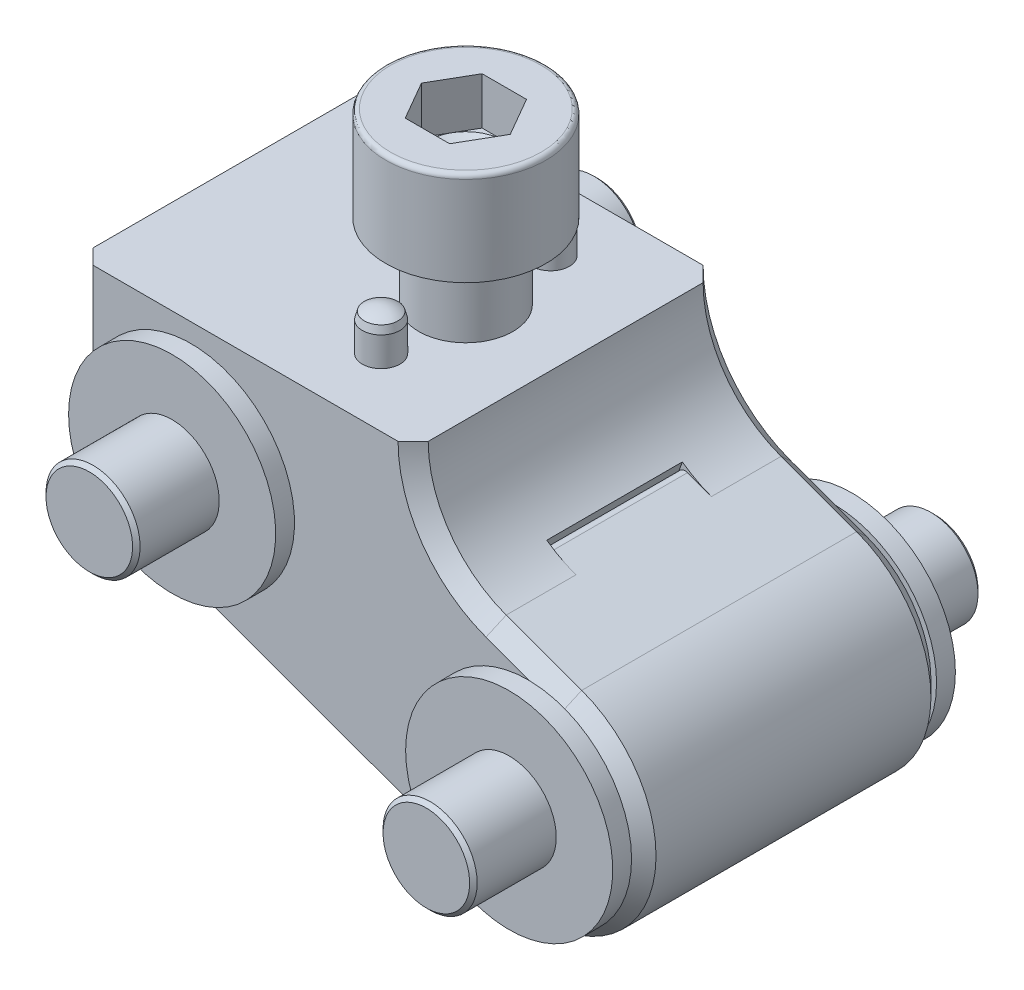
ISO-10303-21;
HEADER;
FILE_DESCRIPTION(('STEP AP214'),'2;1');
FILE_NAME('part.step','',(''),(''),'','','');
FILE_SCHEMA(('AUTOMOTIVE_DESIGN { 1 0 10303 214 1 1 1 1 }'));
ENDSEC;
DATA;
#1=APPLICATION_CONTEXT('core data for automotive mechanical design processes');
#2=APPLICATION_PROTOCOL_DEFINITION('international standard','automotive_design',2000,#1);
#3=PRODUCT_CONTEXT('',#1,'mechanical');
#4=PRODUCT('Part','Part','',(#3));
#5=PRODUCT_RELATED_PRODUCT_CATEGORY('part','',(#4));
#6=PRODUCT_DEFINITION_FORMATION('','',#4);
#7=PRODUCT_DEFINITION_CONTEXT('part definition',#1,'design');
#8=PRODUCT_DEFINITION('design','',#6,#7);
#9=PRODUCT_DEFINITION_SHAPE('','',#8);
#10=(LENGTH_UNIT() NAMED_UNIT(*) SI_UNIT(.MILLI.,.METRE.));
#11=(NAMED_UNIT(*) PLANE_ANGLE_UNIT() SI_UNIT($,.RADIAN.));
#12=(NAMED_UNIT(*) SI_UNIT($,.STERADIAN.) SOLID_ANGLE_UNIT());
#13=UNCERTAINTY_MEASURE_WITH_UNIT(LENGTH_MEASURE(1.E-05),#10,'distance_accuracy_value','');
#14=(GEOMETRIC_REPRESENTATION_CONTEXT(3) GLOBAL_UNCERTAINTY_ASSIGNED_CONTEXT((#13)) GLOBAL_UNIT_ASSIGNED_CONTEXT((#10,
#11,#12)) REPRESENTATION_CONTEXT('',''));
#15=CARTESIAN_POINT('',(0.,0.,0.));
#16=DIRECTION('',(0.,0.,1.));
#17=DIRECTION('',(1.,0.,0.));
#18=AXIS2_PLACEMENT_3D('',#15,#16,#17);
#19=CARTESIAN_POINT('',(10.3216643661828,174.277240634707,2.04200000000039));
#20=DIRECTION('',(-2.66238420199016E-13,-1.,0.));
#21=DIRECTION('',(1.,-2.66238420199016E-13,0.));
#22=AXIS2_PLACEMENT_3D('',#19,#20,#21);
#23=PLANE('',#22);
#24=DIRECTION('',(1.,-2.66238420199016E-13,0.));
#25=VECTOR('',#24,1.);
#26=CARTESIAN_POINT('',(10.3216643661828,174.277240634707,-2.04199999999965));
#27=LINE('',#26,#25);
#28=CARTESIAN_POINT('',(13.8585121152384,174.2772406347,-2.04200000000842));
#29=VERTEX_POINT('',#28);
#30=CARTESIAN_POINT('',(15.0374613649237,174.277240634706,-2.04199999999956));
#31=VERTEX_POINT('',#30);
#32=EDGE_CURVE('E251',#29,#31,#27,.T.);
#33=ORIENTED_EDGE('',*,*,#32,.F.);
#34=CARTESIAN_POINT('',(13.8585121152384,174.277240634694,3.44993131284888E-13));
#35=DIRECTION('',(2.65050795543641E-13,1.,0.));
#36=DIRECTION('',(-1.,2.65050795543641E-13,0.));
#37=AXIS2_PLACEMENT_3D('',#34,#35,#36);
#38=CIRCLE('',#37,2.04200000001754);
#39=CARTESIAN_POINT('',(15.6269359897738,174.2772406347,-1.02100000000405));
#40=VERTEX_POINT('',#39);
#41=EDGE_CURVE('E253',#29,#40,#38,.F.);
#42=ORIENTED_EDGE('',*,*,#41,.T.);
#43=DIRECTION('',(0.499999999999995,-1.41255829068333E-13,0.866025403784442));
#44=VECTOR('',#43,1.);
#45=CARTESIAN_POINT('',(15.0374613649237,174.277240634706,-2.04199999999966));
#46=LINE('',#45,#44);
#47=EDGE_CURVE('E255',#31,#40,#46,.T.);
#48=ORIENTED_EDGE('',*,*,#47,.F.);
#49=EDGE_LOOP('',(#33,#42,#48));
#50=FACE_BOUND('',#49,.T.);
#51=ADVANCED_FACE('F17',(#50),#23,.F.);
#52=CARTESIAN_POINT('',(10.3216643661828,174.277240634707,2.04200000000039));
#53=DIRECTION('',(-2.66238420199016E-13,-1.,0.));
#54=DIRECTION('',(1.,-2.66238420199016E-13,0.));
#55=AXIS2_PLACEMENT_3D('',#52,#53,#54);
#56=PLANE('',#55);
#57=DIRECTION('',(0.500000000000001,-1.41255829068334E-13,0.866025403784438));
#58=VECTOR('',#57,1.);
#59=CARTESIAN_POINT('',(15.6269359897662,174.277240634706,-1.02099999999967));
#60=LINE('',#59,#58);
#61=CARTESIAN_POINT('',(16.2164106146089,174.277240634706,2.14713560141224E-13));
#62=VERTEX_POINT('',#61);
#63=EDGE_CURVE('E332',#40,#62,#60,.T.);
#64=ORIENTED_EDGE('',*,*,#63,.F.);
#65=CARTESIAN_POINT('',(13.8585121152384,174.277240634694,3.44993131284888E-13));
#66=DIRECTION('',(2.65050795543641E-13,1.,0.));
#67=DIRECTION('',(-1.,2.65050795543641E-13,0.));
#68=AXIS2_PLACEMENT_3D('',#65,#66,#67);
#69=CIRCLE('',#68,2.04200000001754);
#70=CARTESIAN_POINT('',(15.6269359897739,174.2772406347,1.02100000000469));
#71=VERTEX_POINT('',#70);
#72=EDGE_CURVE('E271',#40,#71,#69,.F.);
#73=ORIENTED_EDGE('',*,*,#72,.T.);
#74=DIRECTION('',(-0.499999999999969,1.41255829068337E-13,0.866025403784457));
#75=VECTOR('',#74,1.);
#76=CARTESIAN_POINT('',(16.2164106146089,174.277240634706,3.17454396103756E-13));
#77=LINE('',#76,#75);
#78=EDGE_CURVE('E327',#62,#71,#77,.T.);
#79=ORIENTED_EDGE('',*,*,#78,.F.);
#80=EDGE_LOOP('',(#64,#73,#79));
#81=FACE_BOUND('',#80,.T.);
#82=ADVANCED_FACE('F845',(#81),#56,.F.);
#83=CARTESIAN_POINT('',(10.3216643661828,174.277240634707,2.04200000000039));
#84=DIRECTION('',(-2.66238420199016E-13,-1.,0.));
#85=DIRECTION('',(1.,-2.66238420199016E-13,0.));
#86=AXIS2_PLACEMENT_3D('',#83,#84,#85);
#87=PLANE('',#86);
#88=DIRECTION('',(-0.499999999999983,1.4125582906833E-13,0.866025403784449));
#89=VECTOR('',#88,1.);
#90=CARTESIAN_POINT('',(15.6269359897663,174.277240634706,1.02100000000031));
#91=LINE('',#90,#89);
#92=CARTESIAN_POINT('',(15.0374613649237,174.277240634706,2.04200000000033));
#93=VERTEX_POINT('',#92);
#94=EDGE_CURVE('E322',#71,#93,#91,.T.);
#95=ORIENTED_EDGE('',*,*,#94,.F.);
#96=CARTESIAN_POINT('',(13.8585121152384,174.277240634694,3.44993131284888E-13));
#97=DIRECTION('',(2.65050795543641E-13,1.,0.));
#98=DIRECTION('',(-1.,2.65050795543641E-13,0.));
#99=AXIS2_PLACEMENT_3D('',#96,#97,#98);
#100=CIRCLE('',#99,2.04200000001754);
#101=CARTESIAN_POINT('',(13.8585121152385,174.2772406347,2.04200000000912));
#102=VERTEX_POINT('',#101);
#103=EDGE_CURVE('E512',#71,#102,#100,.F.);
#104=ORIENTED_EDGE('',*,*,#103,.T.);
#105=DIRECTION('',(1.,-2.66238420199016E-13,0.));
#106=VECTOR('',#105,1.);
#107=CARTESIAN_POINT('',(10.3216643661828,174.277240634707,2.04200000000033));
#108=LINE('',#107,#106);
#109=EDGE_CURVE('E317',#93,#102,#108,.F.);
#110=ORIENTED_EDGE('',*,*,#109,.F.);
#111=EDGE_LOOP('',(#95,#104,#110));
#112=FACE_BOUND('',#111,.T.);
#113=ADVANCED_FACE('F842',(#112),#87,.F.);
#114=CARTESIAN_POINT('',(10.3216643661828,174.277240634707,2.04200000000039));
#115=DIRECTION('',(-2.66238420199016E-13,-1.,0.));
#116=DIRECTION('',(1.,-2.66238420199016E-13,0.));
#117=AXIS2_PLACEMENT_3D('',#114,#115,#116);
#118=PLANE('',#117);
#119=DIRECTION('',(1.,-2.66238420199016E-13,0.));
#120=VECTOR('',#119,1.);
#121=CARTESIAN_POINT('',(10.3216643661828,174.277240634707,2.04200000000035));
#122=LINE('',#121,#120);
#123=CARTESIAN_POINT('',(12.6795628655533,174.277240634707,2.04200000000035));
#124=VERTEX_POINT('',#123);
#125=EDGE_CURVE('E312',#102,#124,#122,.F.);
#126=ORIENTED_EDGE('',*,*,#125,.F.);
#127=CARTESIAN_POINT('',(13.8585121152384,174.277240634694,3.44993131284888E-13));
#128=DIRECTION('',(2.65050795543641E-13,1.,0.));
#129=DIRECTION('',(-1.,2.65050795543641E-13,0.));
#130=AXIS2_PLACEMENT_3D('',#127,#128,#129);
#131=CIRCLE('',#130,2.04200000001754);
#132=CARTESIAN_POINT('',(12.090088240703,174.277240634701,1.02100000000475));
#133=VERTEX_POINT('',#132);
#134=EDGE_CURVE('E509',#102,#133,#131,.F.);
#135=ORIENTED_EDGE('',*,*,#134,.T.);
#136=DIRECTION('',(-0.50000000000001,1.41255829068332E-13,-0.866025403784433));
#137=VECTOR('',#136,1.);
#138=CARTESIAN_POINT('',(12.6795628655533,174.277240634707,2.04200000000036));
#139=LINE('',#138,#137);
#140=EDGE_CURVE('E307',#124,#133,#139,.T.);
#141=ORIENTED_EDGE('',*,*,#140,.F.);
#142=EDGE_LOOP('',(#126,#135,#141));
#143=FACE_BOUND('',#142,.T.);
#144=ADVANCED_FACE('F840',(#143),#118,.F.);
#145=CARTESIAN_POINT('',(10.3216643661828,174.277240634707,2.04200000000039));
#146=DIRECTION('',(-2.66238420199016E-13,-1.,0.));
#147=DIRECTION('',(1.,-2.66238420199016E-13,0.));
#148=AXIS2_PLACEMENT_3D('',#145,#146,#147);
#149=PLANE('',#148);
#150=DIRECTION('',(-0.500000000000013,1.41255829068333E-13,-0.866025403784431));
#151=VECTOR('',#150,1.);
#152=CARTESIAN_POINT('',(12.0900882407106,174.277240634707,1.02100000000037));
#153=LINE('',#152,#151);
#154=CARTESIAN_POINT('',(11.5006136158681,174.277240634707,4.77353626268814E-13));
#155=VERTEX_POINT('',#154);
#156=EDGE_CURVE('E302',#133,#155,#153,.T.);
#157=ORIENTED_EDGE('',*,*,#156,.F.);
#158=CARTESIAN_POINT('',(13.8585121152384,174.277240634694,3.44993131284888E-13));
#159=DIRECTION('',(2.65050795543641E-13,1.,0.));
#160=DIRECTION('',(-1.,2.65050795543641E-13,0.));
#161=AXIS2_PLACEMENT_3D('',#158,#159,#160);
#162=CIRCLE('',#161,2.04200000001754);
#163=CARTESIAN_POINT('',(12.090088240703,174.277240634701,-1.02100000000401));
#164=VERTEX_POINT('',#163);
#165=EDGE_CURVE('E279',#133,#164,#162,.F.);
#166=ORIENTED_EDGE('',*,*,#165,.T.);
#167=DIRECTION('',(0.499999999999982,-1.41255829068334E-13,-0.866025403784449));
#168=VECTOR('',#167,1.);
#169=CARTESIAN_POINT('',(11.500613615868,174.277240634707,3.81205483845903E-13));
#170=LINE('',#169,#168);
#171=EDGE_CURVE('E272',#155,#164,#170,.T.);
#172=ORIENTED_EDGE('',*,*,#171,.F.);
#173=EDGE_LOOP('',(#157,#166,#172));
#174=FACE_BOUND('',#173,.T.);
#175=ADVANCED_FACE('F837',(#174),#149,.F.);
#176=CARTESIAN_POINT('',(13.8585121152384,174.277240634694,3.44993131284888E-13));
#177=DIRECTION('',(2.65050795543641E-13,1.,0.));
#178=DIRECTION('',(-1.,2.65050795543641E-13,0.));
#179=AXIS2_PLACEMENT_3D('',#176,#177,#178);
#180=CONICAL_SURFACE('',#179,2.04200000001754,1.04719755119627);
#181=CARTESIAN_POINT('',(13.8585121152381,173.098291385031,-5.6843418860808E-11));
#182=VERTEX_POINT('',#181);
#183=VERTEX_LOOP('',#182);
#184=FACE_BOUND('',#183,.T.);
#185=ORIENTED_EDGE('',*,*,#41,.F.);
#186=CARTESIAN_POINT('',(13.8585121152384,174.277240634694,3.44993131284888E-13));
#187=DIRECTION('',(2.65050795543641E-13,1.,0.));
#188=DIRECTION('',(-1.,2.65050795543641E-13,0.));
#189=AXIS2_PLACEMENT_3D('',#186,#187,#188);
#190=CIRCLE('',#189,2.04200000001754);
#191=EDGE_CURVE('E267',#29,#164,#190,.T.);
#192=ORIENTED_EDGE('',*,*,#191,.T.);
#193=ORIENTED_EDGE('',*,*,#165,.F.);
#194=ORIENTED_EDGE('',*,*,#134,.F.);
#195=ORIENTED_EDGE('',*,*,#103,.F.);
#196=ORIENTED_EDGE('',*,*,#72,.F.);
#197=EDGE_LOOP('',(#185,#192,#193,#194,#195,#196));
#198=FACE_BOUND('',#197,.T.);
#199=ADVANCED_FACE('F265',(#184,#198),#180,.F.);
#200=CARTESIAN_POINT('',(10.3216643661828,174.277240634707,2.04200000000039));
#201=DIRECTION('',(-2.66238420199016E-13,-1.,0.));
#202=DIRECTION('',(1.,-2.66238420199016E-13,0.));
#203=AXIS2_PLACEMENT_3D('',#200,#201,#202);
#204=PLANE('',#203);
#205=DIRECTION('',(0.499999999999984,0.,-0.866025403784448));
#206=VECTOR('',#205,1.);
#207=CARTESIAN_POINT('',(11.500613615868,174.277240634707,3.81284122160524E-13));
#208=LINE('',#207,#206);
#209=CARTESIAN_POINT('',(12.6795628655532,174.277240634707,-2.04199999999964));
#210=VERTEX_POINT('',#209);
#211=EDGE_CURVE('E278',#164,#210,#208,.T.);
#212=ORIENTED_EDGE('',*,*,#211,.F.);
#213=ORIENTED_EDGE('',*,*,#191,.F.);
#214=DIRECTION('',(-1.,0.,0.));
#215=VECTOR('',#214,1.);
#216=CARTESIAN_POINT('',(15.0374613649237,174.277240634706,-2.04199999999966));
#217=LINE('',#216,#215);
#218=EDGE_CURVE('E277',#29,#210,#217,.T.);
#219=ORIENTED_EDGE('',*,*,#218,.T.);
#220=EDGE_LOOP('',(#212,#213,#219));
#221=FACE_BOUND('',#220,.T.);
#222=ADVANCED_FACE('F276',(#221),#204,.F.);
#223=CARTESIAN_POINT('',(11.500613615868,174.277240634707,3.81284122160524E-13));
#224=DIRECTION('',(0.866025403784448,-2.28899230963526E-13,0.499999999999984));
#225=DIRECTION('',(0.499999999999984,0.,-0.866025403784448));
#226=AXIS2_PLACEMENT_3D('',#223,#224,#225);
#227=PLANE('',#226);
#228=ORIENTED_EDGE('',*,*,#211,.T.);
#229=DIRECTION('',(0.,1.,0.));
#230=VECTOR('',#229,1.);
#231=CARTESIAN_POINT('',(12.6795628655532,174.277240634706,-2.04199999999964));
#232=LINE('',#231,#230);
#233=CARTESIAN_POINT('',(12.6795628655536,176.777240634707,-2.0419999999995));
#234=VERTEX_POINT('',#233);
#235=EDGE_CURVE('E285',#210,#234,#232,.T.);
#236=ORIENTED_EDGE('',*,*,#235,.T.);
#237=DIRECTION('',(0.499999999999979,-1.41255829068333E-13,-0.86602540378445));
#238=VECTOR('',#237,1.);
#239=CARTESIAN_POINT('',(11.5006136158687,176.777240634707,3.72934100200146E-13));
#240=LINE('',#239,#238);
#241=CARTESIAN_POINT('',(11.5006136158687,176.777240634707,3.71282812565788E-13));
#242=VERTEX_POINT('',#241);
#243=EDGE_CURVE('E353',#242,#234,#240,.T.);
#244=ORIENTED_EDGE('',*,*,#243,.F.);
#245=DIRECTION('',(2.01125081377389E-13,1.,-1.16119619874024E-13));
#246=VECTOR('',#245,1.);
#247=CARTESIAN_POINT('',(11.5006136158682,174.277240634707,6.69649911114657E-13));
#248=LINE('',#247,#246);
#249=EDGE_CURVE('E344',#242,#155,#248,.F.);
#250=ORIENTED_EDGE('',*,*,#249,.T.);
#251=ORIENTED_EDGE('',*,*,#171,.T.);
#252=EDGE_LOOP('',(#228,#236,#244,#250,#251));
#253=FACE_BOUND('',#252,.T.);
#254=ADVANCED_FACE('F822',(#253),#227,.T.);
#255=CARTESIAN_POINT('',(15.0374613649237,174.277240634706,-2.04199999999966));
#256=DIRECTION('',(0.,0.,-1.));
#257=DIRECTION('',(-1.,0.,0.));
#258=AXIS2_PLACEMENT_3D('',#255,#256,#257);
#259=PLANE('',#258);
#260=ORIENTED_EDGE('',*,*,#235,.F.);
#261=ORIENTED_EDGE('',*,*,#218,.F.);
#262=ORIENTED_EDGE('',*,*,#32,.T.);
#263=DIRECTION('',(2.01125081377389E-13,1.,-1.16119619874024E-13));
#264=VECTOR('',#263,1.);
#265=CARTESIAN_POINT('',(15.0374613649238,174.277240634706,-2.04199999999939));
#266=LINE('',#265,#264);
#267=CARTESIAN_POINT('',(15.0374613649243,176.777240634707,-2.04199999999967));
#268=VERTEX_POINT('',#267);
#269=EDGE_CURVE('E287',#268,#31,#266,.F.);
#270=ORIENTED_EDGE('',*,*,#269,.F.);
#271=DIRECTION('',(-1.,2.66238420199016E-13,0.));
#272=VECTOR('',#271,1.);
#273=CARTESIAN_POINT('',(13.8585121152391,176.777240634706,-2.04199999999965));
#274=LINE('',#273,#272);
#275=EDGE_CURVE('E819',#234,#268,#274,.F.);
#276=ORIENTED_EDGE('',*,*,#275,.F.);
#277=EDGE_LOOP('',(#260,#261,#262,#270,#276));
#278=FACE_BOUND('',#277,.T.);
#279=ADVANCED_FACE('F282',(#278),#259,.F.);
#280=CARTESIAN_POINT('',(15.0374613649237,174.277240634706,-2.04199999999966));
#281=DIRECTION('',(-0.866025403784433,2.32239239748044E-13,0.50000000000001));
#282=DIRECTION('',(0.50000000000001,0.,0.866025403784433));
#283=AXIS2_PLACEMENT_3D('',#280,#281,#282);
#284=PLANE('',#283);
#285=ORIENTED_EDGE('',*,*,#63,.T.);
#286=DIRECTION('',(1.98232548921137E-13,1.,1.14449615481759E-13));
#287=VECTOR('',#286,1.);
#288=CARTESIAN_POINT('',(16.216410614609,174.277240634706,0.));
#289=LINE('',#288,#287);
#290=CARTESIAN_POINT('',(16.2164106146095,176.777240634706,1.56563637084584E-13));
#291=VERTEX_POINT('',#290);
#292=EDGE_CURVE('E358',#291,#62,#289,.F.);
#293=ORIENTED_EDGE('',*,*,#292,.F.);
#294=DIRECTION('',(0.500000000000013,-1.41255829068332E-13,0.866025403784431));
#295=VECTOR('',#294,1.);
#296=CARTESIAN_POINT('',(15.0374613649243,176.777240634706,-2.04199999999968));
#297=LINE('',#296,#295);
#298=EDGE_CURVE('E817',#268,#291,#297,.T.);
#299=ORIENTED_EDGE('',*,*,#298,.F.);
#300=ORIENTED_EDGE('',*,*,#269,.T.);
#301=ORIENTED_EDGE('',*,*,#47,.T.);
#302=EDGE_LOOP('',(#285,#293,#299,#300,#301));
#303=FACE_BOUND('',#302,.T.);
#304=ADVANCED_FACE('F826',(#303),#284,.T.);
#305=CARTESIAN_POINT('',(16.2164106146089,174.277240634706,3.17258704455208E-13));
#306=DIRECTION('',(-0.866025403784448,2.28899230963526E-13,-0.499999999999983));
#307=DIRECTION('',(-0.499999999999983,0.,0.866025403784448));
#308=AXIS2_PLACEMENT_3D('',#305,#306,#307);
#309=PLANE('',#308);
#310=ORIENTED_EDGE('',*,*,#94,.T.);
#311=DIRECTION('',(0.,1.,0.));
#312=VECTOR('',#311,1.);
#313=CARTESIAN_POINT('',(15.0374613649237,174.277240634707,2.04200000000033));
#314=LINE('',#313,#312);
#315=CARTESIAN_POINT('',(15.0374613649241,176.777240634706,2.04200000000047));
#316=VERTEX_POINT('',#315);
#317=EDGE_CURVE('E348',#93,#316,#314,.T.);
#318=ORIENTED_EDGE('',*,*,#317,.T.);
#319=DIRECTION('',(-0.499999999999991,1.41255829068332E-13,0.866025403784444));
#320=VECTOR('',#319,1.);
#321=CARTESIAN_POINT('',(16.2164106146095,176.777240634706,3.0890868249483E-13));
#322=LINE('',#321,#320);
#323=EDGE_CURVE('E813',#291,#316,#322,.T.);
#324=ORIENTED_EDGE('',*,*,#323,.F.);
#325=ORIENTED_EDGE('',*,*,#292,.T.);
#326=ORIENTED_EDGE('',*,*,#78,.T.);
#327=EDGE_LOOP('',(#310,#318,#324,#325,#326));
#328=FACE_BOUND('',#327,.T.);
#329=ADVANCED_FACE('F831',(#328),#309,.T.);
#330=CARTESIAN_POINT('',(12.6795628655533,174.277240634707,2.04200000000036));
#331=DIRECTION('',(0.,0.,1.));
#332=DIRECTION('',(1.,0.,0.));
#333=AXIS2_PLACEMENT_3D('',#330,#331,#332);
#334=PLANE('',#333);
#335=ORIENTED_EDGE('',*,*,#317,.F.);
#336=ORIENTED_EDGE('',*,*,#109,.T.);
#337=ORIENTED_EDGE('',*,*,#125,.T.);
#338=DIRECTION('',(2.01125081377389E-13,1.,-1.16119619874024E-13));
#339=VECTOR('',#338,1.);
#340=CARTESIAN_POINT('',(12.6795628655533,174.277240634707,2.04200000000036));
#341=LINE('',#340,#339);
#342=CARTESIAN_POINT('',(12.6795628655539,176.777240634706,2.04200000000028));
#343=VERTEX_POINT('',#342);
#344=EDGE_CURVE('E347',#124,#343,#341,.T.);
#345=ORIENTED_EDGE('',*,*,#344,.T.);
#346=DIRECTION('',(-1.,2.66238420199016E-13,0.));
#347=VECTOR('',#346,1.);
#348=CARTESIAN_POINT('',(13.8585121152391,176.777240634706,2.04200000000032));
#349=LINE('',#348,#347);
#350=EDGE_CURVE('E810',#316,#343,#349,.T.);
#351=ORIENTED_EDGE('',*,*,#350,.F.);
#352=EDGE_LOOP('',(#335,#336,#337,#345,#351));
#353=FACE_BOUND('',#352,.T.);
#354=ADVANCED_FACE('F833',(#353),#334,.F.);
#355=CARTESIAN_POINT('',(11.500613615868,174.277240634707,3.81284122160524E-13));
#356=DIRECTION('',(-0.866025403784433,2.32239239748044E-13,0.50000000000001));
#357=DIRECTION('',(0.50000000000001,0.,0.866025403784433));
#358=AXIS2_PLACEMENT_3D('',#355,#356,#357);
#359=PLANE('',#358);
#360=ORIENTED_EDGE('',*,*,#344,.F.);
#361=ORIENTED_EDGE('',*,*,#140,.T.);
#362=ORIENTED_EDGE('',*,*,#156,.T.);
#363=ORIENTED_EDGE('',*,*,#249,.F.);
#364=DIRECTION('',(-0.500000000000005,1.41255829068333E-13,-0.866025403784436));
#365=VECTOR('',#364,1.);
#366=CARTESIAN_POINT('',(12.6795628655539,176.777240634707,2.04200000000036));
#367=LINE('',#366,#365);
#368=EDGE_CURVE('E808',#343,#242,#367,.T.);
#369=ORIENTED_EDGE('',*,*,#368,.F.);
#370=EDGE_LOOP('',(#360,#361,#362,#363,#369));
#371=FACE_BOUND('',#370,.T.);
#372=ADVANCED_FACE('F786',(#371),#359,.F.);
#373=CARTESIAN_POINT('',(13.8585121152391,176.777240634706,3.36693002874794E-13));
#374=DIRECTION('',(2.66238420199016E-13,1.,0.));
#375=DIRECTION('',(-1.,2.66238420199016E-13,0.));
#376=AXIS2_PLACEMENT_3D('',#373,#374,#375);
#377=PLANE('',#376);
#378=CARTESIAN_POINT('',(13.8585121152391,176.777240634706,3.36693002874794E-13));
#379=DIRECTION('',(-2.66238420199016E-13,-1.,0.));
#380=DIRECTION('',(-1.37043154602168E-13,0.,1.));
#381=AXIS2_PLACEMENT_3D('',#378,#379,#380);
#382=CIRCLE('',#381,4.);
#383=CARTESIAN_POINT('',(13.858512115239,176.777240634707,4.00000000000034));
#384=VERTEX_POINT('',#383);
#385=CARTESIAN_POINT('',(13.8585121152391,176.777240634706,-3.99999999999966));
#386=VERTEX_POINT('',#385);
#387=EDGE_CURVE('E806',#384,#386,#382,.T.);
#388=ORIENTED_EDGE('',*,*,#387,.F.);
#389=CARTESIAN_POINT('',(13.8585121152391,176.777240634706,3.36693002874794E-13));
#390=DIRECTION('',(-2.66238420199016E-13,-1.,0.));
#391=DIRECTION('',(0.,0.,-1.));
#392=AXIS2_PLACEMENT_3D('',#389,#390,#391);
#393=CIRCLE('',#392,4.);
#394=EDGE_CURVE('E505',#386,#384,#393,.T.);
#395=ORIENTED_EDGE('',*,*,#394,.F.);
#396=EDGE_LOOP('',(#388,#395));
#397=FACE_BOUND('',#396,.T.);
#398=ORIENTED_EDGE('',*,*,#350,.T.);
#399=ORIENTED_EDGE('',*,*,#368,.T.);
#400=ORIENTED_EDGE('',*,*,#243,.T.);
#401=ORIENTED_EDGE('',*,*,#275,.T.);
#402=ORIENTED_EDGE('',*,*,#298,.T.);
#403=ORIENTED_EDGE('',*,*,#323,.T.);
#404=EDGE_LOOP('',(#398,#399,#400,#401,#402,#403));
#405=FACE_BOUND('',#404,.T.);
#406=ADVANCED_FACE('F781',(#397,#405),#377,.T.);
#407=CARTESIAN_POINT('',(5.64978384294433,163.10213725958,13.5000000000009));
#408=DIRECTION('',(0.,0.,1.));
#409=DIRECTION('',(1.,0.,0.));
#410=AXIS2_PLACEMENT_3D('',#407,#408,#409);
#411=PLANE('',#410);
#412=CARTESIAN_POINT('',(7.35851211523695,161.277240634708,13.4999999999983));
#413=DIRECTION('',(0.,0.,-1.));
#414=DIRECTION('',(-1.,0.,0.));
#415=AXIS2_PLACEMENT_3D('',#412,#413,#414);
#416=CIRCLE('',#415,2.30000000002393);
#417=CARTESIAN_POINT('',(5.05851211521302,161.277240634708,13.4999999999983));
#418=VERTEX_POINT('',#417);
#419=EDGE_CURVE('E503',#418,#418,#416,.T.);
#420=ORIENTED_EDGE('',*,*,#419,.F.);
#421=EDGE_LOOP('',(#420));
#422=FACE_BOUND('',#421,.T.);
#423=ADVANCED_FACE('F777',(#422),#411,.T.);
#424=CARTESIAN_POINT('',(25.2596565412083,154.761756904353,13.5000000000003));
#425=DIRECTION('',(0.,0.,1.));
#426=DIRECTION('',(1.,0.,0.));
#427=AXIS2_PLACEMENT_3D('',#424,#425,#426);
#428=PLANE('',#427);
#429=CARTESIAN_POINT('',(25.2596565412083,154.761756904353,13.5000000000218));
#430=DIRECTION('',(0.,0.,-1.));
#431=DIRECTION('',(-1.,0.,0.));
#432=AXIS2_PLACEMENT_3D('',#429,#430,#431);
#433=CIRCLE('',#432,2.30000000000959);
#434=CARTESIAN_POINT('',(22.9596565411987,154.761756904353,13.5000000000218));
#435=VERTEX_POINT('',#434);
#436=EDGE_CURVE('E500',#435,#435,#433,.T.);
#437=ORIENTED_EDGE('',*,*,#436,.F.);
#438=EDGE_LOOP('',(#437));
#439=FACE_BOUND('',#438,.T.);
#440=ADVANCED_FACE('F773',(#439),#428,.T.);
#441=CARTESIAN_POINT('',(24.5251988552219,157.151437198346,-13.4999999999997));
#442=DIRECTION('',(0.,0.,-1.));
#443=DIRECTION('',(-1.,0.,0.));
#444=AXIS2_PLACEMENT_3D('',#441,#442,#443);
#445=PLANE('',#444);
#446=CARTESIAN_POINT('',(25.2596565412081,154.761756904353,-13.5000000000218));
#447=DIRECTION('',(0.,0.,1.));
#448=DIRECTION('',(1.,0.,0.));
#449=AXIS2_PLACEMENT_3D('',#446,#447,#448);
#450=CIRCLE('',#449,2.29999999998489);
#451=CARTESIAN_POINT('',(27.559656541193,154.761756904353,-13.5000000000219));
#452=VERTEX_POINT('',#451);
#453=EDGE_CURVE('E497',#452,#452,#450,.T.);
#454=ORIENTED_EDGE('',*,*,#453,.F.);
#455=EDGE_LOOP('',(#454));
#456=FACE_BOUND('',#455,.T.);
#457=ADVANCED_FACE('F769',(#456),#445,.T.);
#458=CARTESIAN_POINT('',(7.35851211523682,161.277240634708,-13.4999999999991));
#459=DIRECTION('',(0.,0.,-1.));
#460=DIRECTION('',(-1.,0.,0.));
#461=AXIS2_PLACEMENT_3D('',#458,#459,#460);
#462=PLANE('',#461);
#463=CARTESIAN_POINT('',(7.35851211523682,161.277240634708,-13.5000000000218));
#464=DIRECTION('',(0.,0.,1.));
#465=DIRECTION('',(1.,0.,0.));
#466=AXIS2_PLACEMENT_3D('',#463,#464,#465);
#467=CIRCLE('',#466,2.30000000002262);
#468=CARTESIAN_POINT('',(9.65851211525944,161.277240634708,-13.5000000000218));
#469=VERTEX_POINT('',#468);
#470=EDGE_CURVE('E493',#469,#469,#467,.T.);
#471=ORIENTED_EDGE('',*,*,#470,.F.);
#472=EDGE_LOOP('',(#471));
#473=FACE_BOUND('',#472,.T.);
#474=ADVANCED_FACE('F763',(#473),#462,.T.);
#475=CARTESIAN_POINT('',(13.858512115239,176.527240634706,3.37528005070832E-13));
#476=DIRECTION('',(2.66238420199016E-13,1.,0.));
#477=DIRECTION('',(0.,0.,-1.));
#478=AXIS2_PLACEMENT_3D('',#475,#476,#477);
#479=TOROIDAL_SURFACE('',#478,4.,0.25);
#480=CARTESIAN_POINT('',(13.858512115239,176.527240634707,4.39630881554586E-13));
#481=DIRECTION('',(2.66238420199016E-13,1.,0.));
#482=DIRECTION('',(-1.,2.66238420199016E-13,0.));
#483=AXIS2_PLACEMENT_3D('',#480,#481,#482);
#484=CIRCLE('',#483,4.25);
#485=CARTESIAN_POINT('',(9.60851211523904,176.527240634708,4.39630881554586E-13));
#486=VERTEX_POINT('',#485);
#487=EDGE_CURVE('E496',#486,#486,#484,.F.);
#488=ORIENTED_EDGE('',*,*,#487,.F.);
#489=EDGE_LOOP('',(#488));
#490=FACE_BOUND('',#489,.T.);
#491=ORIENTED_EDGE('',*,*,#394,.T.);
#492=ORIENTED_EDGE('',*,*,#387,.T.);
#493=EDGE_LOOP('',(#491,#492));
#494=FACE_BOUND('',#493,.T.);
#495=ADVANCED_FACE('F757',(#490,#494),#479,.T.);
#496=CARTESIAN_POINT('',(7.35851211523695,161.277240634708,13.3000000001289));
#497=DIRECTION('',(0.,0.,-1.));
#498=DIRECTION('',(-1.,0.,0.));
#499=AXIS2_PLACEMENT_3D('',#496,#497,#498);
#500=CONICAL_SURFACE('',#499,2.49999999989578,0.785398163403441);
#501=CARTESIAN_POINT('',(7.35851211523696,161.277240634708,13.3000000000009));
#502=DIRECTION('',(0.,0.,-1.));
#503=DIRECTION('',(-1.,0.,0.));
#504=AXIS2_PLACEMENT_3D('',#501,#502,#503);
#505=CIRCLE('',#504,2.5);
#506=CARTESIAN_POINT('',(4.85851211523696,161.277240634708,13.3000000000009));
#507=VERTEX_POINT('',#506);
#508=EDGE_CURVE('E751',#507,#507,#505,.T.);
#509=ORIENTED_EDGE('',*,*,#508,.F.);
#510=EDGE_LOOP('',(#509));
#511=FACE_BOUND('',#510,.T.);
#512=ORIENTED_EDGE('',*,*,#419,.T.);
#513=EDGE_LOOP('',(#512));
#514=FACE_BOUND('',#513,.T.);
#515=ADVANCED_FACE('F762',(#511,#514),#500,.T.);
#516=CARTESIAN_POINT('',(25.2596565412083,154.761756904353,13.2999999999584));
#517=DIRECTION('',(0.,0.,-1.));
#518=DIRECTION('',(-1.,0.,0.));
#519=AXIS2_PLACEMENT_3D('',#516,#517,#518);
#520=CONICAL_SURFACE('',#519,2.50000000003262,0.785398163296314);
#521=ORIENTED_EDGE('',*,*,#436,.T.);
#522=EDGE_LOOP('',(#521));
#523=FACE_BOUND('',#522,.T.);
#524=CARTESIAN_POINT('',(25.2596565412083,154.761756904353,13.3000000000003));
#525=DIRECTION('',(0.,0.,1.));
#526=DIRECTION('',(1.,0.,0.));
#527=AXIS2_PLACEMENT_3D('',#524,#525,#526);
#528=CIRCLE('',#527,2.49999999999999);
#529=CARTESIAN_POINT('',(27.7596565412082,154.761756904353,13.3000000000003));
#530=VERTEX_POINT('',#529);
#531=EDGE_CURVE('E737',#530,#530,#528,.F.);
#532=ORIENTED_EDGE('',*,*,#531,.F.);
#533=EDGE_LOOP('',(#532));
#534=FACE_BOUND('',#533,.T.);
#535=ADVANCED_FACE('F1133',(#523,#534),#520,.T.);
#536=CARTESIAN_POINT('',(25.2596565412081,154.761756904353,-13.2999999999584));
#537=DIRECTION('',(0.,0.,1.));
#538=DIRECTION('',(1.,0.,0.));
#539=AXIS2_PLACEMENT_3D('',#536,#537,#538);
#540=CONICAL_SURFACE('',#539,2.50000000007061,0.785398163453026);
#541=CARTESIAN_POINT('',(25.2596565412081,154.761756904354,-13.2999999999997));
#542=DIRECTION('',(0.,0.,1.));
#543=DIRECTION('',(1.,0.,0.));
#544=AXIS2_PLACEMENT_3D('',#541,#542,#543);
#545=CIRCLE('',#544,2.49999999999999);
#546=CARTESIAN_POINT('',(27.7596565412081,154.761756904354,-13.2999999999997));
#547=VERTEX_POINT('',#546);
#548=EDGE_CURVE('E731',#547,#547,#545,.T.);
#549=ORIENTED_EDGE('',*,*,#548,.F.);
#550=EDGE_LOOP('',(#549));
#551=FACE_BOUND('',#550,.T.);
#552=ORIENTED_EDGE('',*,*,#453,.T.);
#553=EDGE_LOOP('',(#552));
#554=FACE_BOUND('',#553,.T.);
#555=ADVANCED_FACE('F1138',(#551,#554),#540,.T.);
#556=CARTESIAN_POINT('',(7.35851211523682,161.277240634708,-13.2999999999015));
#557=DIRECTION('',(0.,0.,1.));
#558=DIRECTION('',(1.,0.,0.));
#559=AXIS2_PLACEMENT_3D('',#556,#557,#558);
#560=CONICAL_SURFACE('',#559,2.50000000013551,0.785398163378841);
#561=ORIENTED_EDGE('',*,*,#470,.T.);
#562=EDGE_LOOP('',(#561));
#563=FACE_BOUND('',#562,.T.);
#564=CARTESIAN_POINT('',(7.35851211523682,161.277240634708,-13.2999999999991));
#565=DIRECTION('',(0.,0.,-1.));
#566=DIRECTION('',(-1.,0.,0.));
#567=AXIS2_PLACEMENT_3D('',#564,#565,#566);
#568=CIRCLE('',#567,2.5);
#569=CARTESIAN_POINT('',(4.85851211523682,161.277240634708,-13.2999999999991));
#570=VERTEX_POINT('',#569);
#571=EDGE_CURVE('E712',#570,#570,#568,.F.);
#572=ORIENTED_EDGE('',*,*,#571,.F.);
#573=EDGE_LOOP('',(#572));
#574=FACE_BOUND('',#573,.T.);
#575=ADVANCED_FACE('F1143',(#563,#574),#560,.T.);
#576=CARTESIAN_POINT('',(18.0564308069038,151.402837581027,3.59999999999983));
#577=DIRECTION('',(0.,0.,-1.));
#578=DIRECTION('',(0.,1.,0.));
#579=AXIS2_PLACEMENT_3D('',#576,#577,#578);
#580=CYLINDRICAL_SURFACE('',#579,0.379999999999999);
#581=CARTESIAN_POINT('',(18.0564308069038,151.402837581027,-3.60000000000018));
#582=DIRECTION('',(0.,0.,-1.));
#583=DIRECTION('',(0.,1.,0.));
#584=AXIS2_PLACEMENT_3D('',#581,#582,#583);
#585=CIRCLE('',#584,0.379999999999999);
#586=CARTESIAN_POINT('',(17.6993476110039,151.532805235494,-3.60000000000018));
#587=VERTEX_POINT('',#586);
#588=CARTESIAN_POINT('',(17.9264631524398,151.045754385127,-3.59999999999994));
#589=VERTEX_POINT('',#588);
#590=EDGE_CURVE('E485',#587,#589,#585,.F.);
#591=ORIENTED_EDGE('',*,*,#590,.T.);
#592=DIRECTION('',(0.,0.,1.));
#593=VECTOR('',#592,1.);
#594=CARTESIAN_POINT('',(17.9264631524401,151.045754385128,3.59999999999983));
#595=LINE('',#594,#593);
#596=CARTESIAN_POINT('',(17.9264631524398,151.045754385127,3.6000000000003));
#597=VERTEX_POINT('',#596);
#598=EDGE_CURVE('E484',#589,#597,#595,.T.);
#599=ORIENTED_EDGE('',*,*,#598,.T.);
#600=CARTESIAN_POINT('',(18.0564308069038,151.402837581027,3.6000000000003));
#601=DIRECTION('',(0.,0.,-1.));
#602=DIRECTION('',(0.,1.,0.));
#603=AXIS2_PLACEMENT_3D('',#600,#601,#602);
#604=CIRCLE('',#603,0.379999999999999);
#605=CARTESIAN_POINT('',(17.6993476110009,151.532805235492,3.60000000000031));
#606=VERTEX_POINT('',#605);
#607=EDGE_CURVE('E489',#597,#606,#604,.T.);
#608=ORIENTED_EDGE('',*,*,#607,.T.);
#609=DIRECTION('',(0.,0.,1.));
#610=VECTOR('',#609,1.);
#611=CARTESIAN_POINT('',(17.6993476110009,151.532805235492,2.86978314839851E-13));
#612=LINE('',#611,#610);
#613=EDGE_CURVE('E673',#606,#587,#612,.F.);
#614=ORIENTED_EDGE('',*,*,#613,.T.);
#615=EDGE_LOOP('',(#591,#599,#608,#614));
#616=FACE_BOUND('',#615,.T.);
#617=ADVANCED_FACE('F1150',(#616),#580,.T.);
#618=CARTESIAN_POINT('',(13.8585121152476,208.527240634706,2.30647723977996E-13));
#619=DIRECTION('',(2.66238420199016E-13,1.,0.));
#620=DIRECTION('',(-1.,2.66238420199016E-13,0.));
#621=AXIS2_PLACEMENT_3D('',#618,#619,#620);
#622=CYLINDRICAL_SURFACE('',#621,4.25);
#623=CARTESIAN_POINT('',(13.8585121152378,171.777240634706,4.70651819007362E-13));
#624=DIRECTION('',(2.66238420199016E-13,1.,0.));
#625=DIRECTION('',(-1.,2.66238420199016E-13,0.));
#626=AXIS2_PLACEMENT_3D('',#623,#624,#625);
#627=CIRCLE('',#626,4.25);
#628=CARTESIAN_POINT('',(9.60851211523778,171.777240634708,4.70651819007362E-13));
#629=VERTEX_POINT('',#628);
#630=EDGE_CURVE('E481',#629,#629,#627,.F.);
#631=ORIENTED_EDGE('',*,*,#630,.F.);
#632=EDGE_LOOP('',(#631));
#633=FACE_BOUND('',#632,.T.);
#634=ORIENTED_EDGE('',*,*,#487,.T.);
#635=EDGE_LOOP('',(#634));
#636=FACE_BOUND('',#635,.T.);
#637=ADVANCED_FACE('F1127',(#633,#636),#622,.T.);
#638=CARTESIAN_POINT('',(7.35851211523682,161.277240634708,-13.4999999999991));
#639=DIRECTION('',(0.,0.,-1.));
#640=DIRECTION('',(-1.,0.,0.));
#641=AXIS2_PLACEMENT_3D('',#638,#639,#640);
#642=CYLINDRICAL_SURFACE('',#641,2.5);
#643=CARTESIAN_POINT('',(7.35851211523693,161.277240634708,9.10000000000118));
#644=DIRECTION('',(0.,0.,-1.));
#645=DIRECTION('',(-1.,0.,0.));
#646=AXIS2_PLACEMENT_3D('',#643,#644,#645);
#647=CIRCLE('',#646,2.5);
#648=CARTESIAN_POINT('',(4.85851211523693,161.277240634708,9.10000000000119));
#649=VERTEX_POINT('',#648);
#650=EDGE_CURVE('E474',#649,#649,#647,.T.);
#651=ORIENTED_EDGE('',*,*,#650,.F.);
#652=EDGE_LOOP('',(#651));
#653=FACE_BOUND('',#652,.T.);
#654=ORIENTED_EDGE('',*,*,#508,.T.);
#655=EDGE_LOOP('',(#654));
#656=FACE_BOUND('',#655,.T.);
#657=ADVANCED_FACE('F1123',(#653,#656),#642,.T.);
#658=CARTESIAN_POINT('',(25.2596565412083,154.761756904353,13.5000000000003));
#659=DIRECTION('',(0.,0.,1.));
#660=DIRECTION('',(1.,0.,0.));
#661=AXIS2_PLACEMENT_3D('',#658,#659,#660);
#662=CYLINDRICAL_SURFACE('',#661,2.49999999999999);
#663=CARTESIAN_POINT('',(25.2596565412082,154.761756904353,9.10000000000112));
#664=DIRECTION('',(0.,0.,1.));
#665=DIRECTION('',(1.,0.,0.));
#666=AXIS2_PLACEMENT_3D('',#663,#664,#665);
#667=CIRCLE('',#666,2.49999999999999);
#668=CARTESIAN_POINT('',(27.7596565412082,154.761756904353,9.10000000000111));
#669=VERTEX_POINT('',#668);
#670=EDGE_CURVE('E471',#669,#669,#667,.F.);
#671=ORIENTED_EDGE('',*,*,#670,.F.);
#672=EDGE_LOOP('',(#671));
#673=FACE_BOUND('',#672,.T.);
#674=ORIENTED_EDGE('',*,*,#531,.T.);
#675=EDGE_LOOP('',(#674));
#676=FACE_BOUND('',#675,.T.);
#677=ADVANCED_FACE('F1126',(#673,#676),#662,.T.);
#678=CARTESIAN_POINT('',(25.2596565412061,154.761756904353,7.29999999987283));
#679=DIRECTION('',(0.,0.,-1.));
#680=DIRECTION('',(0.,1.,0.));
#681=AXIS2_PLACEMENT_3D('',#678,#679,#680);
#682=CONICAL_SURFACE('',#681,6.00000000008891,0.785398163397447);
#683=CARTESIAN_POINT('',(25.2596565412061,154.761756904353,7.3000000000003));
#684=DIRECTION('',(0.,0.,-1.));
#685=DIRECTION('',(0.,1.,0.));
#686=AXIS2_PLACEMENT_3D('',#683,#684,#685);
#687=CIRCLE('',#686,6.00000000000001);
#688=CARTESIAN_POINT('',(27.3117774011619,160.399912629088,7.29999999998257));
#689=VERTEX_POINT('',#688);
#690=CARTESIAN_POINT('',(23.2075356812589,149.123601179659,7.30000000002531));
#691=VERTEX_POINT('',#690);
#692=EDGE_CURVE('E480',#689,#691,#687,.T.);
#693=ORIENTED_EDGE('',*,*,#692,.F.);
#694=DIRECTION('',(-0.241844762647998,-0.664463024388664,0.70710678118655));
#695=VECTOR('',#694,1.);
#696=CARTESIAN_POINT('',(170697.860043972,469073.877440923,-499000.000000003));
#697=LINE('',#696,#695);
#698=CARTESIAN_POINT('',(27.0381612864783,159.648158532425,8.09999999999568));
#699=VERTEX_POINT('',#698);
#700=EDGE_CURVE('E729',#689,#699,#697,.T.);
#701=ORIENTED_EDGE('',*,*,#700,.T.);
#702=CARTESIAN_POINT('',(25.2596565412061,154.761756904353,8.10000000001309));
#703=DIRECTION('',(0.,0.,-1.));
#704=DIRECTION('',(0.,1.,0.));
#705=AXIS2_PLACEMENT_3D('',#702,#703,#704);
#706=CIRCLE('',#705,5.19999999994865);
#707=CARTESIAN_POINT('',(23.4811517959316,149.87535527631,8.1000000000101));
#708=VERTEX_POINT('',#707);
#709=EDGE_CURVE('E467',#708,#699,#706,.F.);
#710=ORIENTED_EDGE('',*,*,#709,.F.);
#711=DIRECTION('',(0.241844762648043,0.664463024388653,0.707106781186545));
#712=VECTOR('',#711,1.);
#713=CARTESIAN_POINT('',(-170647.340730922,-468764.353927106,-499000.));
#714=LINE('',#713,#712);
#715=EDGE_CURVE('E732',#708,#691,#714,.F.);
#716=ORIENTED_EDGE('',*,*,#715,.T.);
#717=EDGE_LOOP('',(#693,#701,#710,#716));
#718=FACE_BOUND('',#717,.T.);
#719=ADVANCED_FACE('F1104',(#718),#682,.T.);
#720=CARTESIAN_POINT('',(25.2596565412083,154.761756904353,13.5000000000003));
#721=DIRECTION('',(0.,0.,1.));
#722=DIRECTION('',(1.,0.,0.));
#723=AXIS2_PLACEMENT_3D('',#720,#721,#722);
#724=CYLINDRICAL_SURFACE('',#723,2.49999999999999);
#725=CARTESIAN_POINT('',(25.2596565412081,154.761756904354,-9.09999999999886));
#726=DIRECTION('',(0.,0.,1.));
#727=DIRECTION('',(1.,0.,0.));
#728=AXIS2_PLACEMENT_3D('',#725,#726,#727);
#729=CIRCLE('',#728,2.49999999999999);
#730=CARTESIAN_POINT('',(27.7596565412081,154.761756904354,-9.09999999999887));
#731=VERTEX_POINT('',#730);
#732=EDGE_CURVE('E461',#731,#731,#729,.T.);
#733=ORIENTED_EDGE('',*,*,#732,.F.);
#734=EDGE_LOOP('',(#733));
#735=FACE_BOUND('',#734,.T.);
#736=ORIENTED_EDGE('',*,*,#548,.T.);
#737=EDGE_LOOP('',(#736));
#738=FACE_BOUND('',#737,.T.);
#739=ADVANCED_FACE('F1163',(#735,#738),#724,.T.);
#740=CARTESIAN_POINT('',(7.35851211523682,161.277240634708,-13.4999999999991));
#741=DIRECTION('',(0.,0.,-1.));
#742=DIRECTION('',(-1.,0.,0.));
#743=AXIS2_PLACEMENT_3D('',#740,#741,#742);
#744=CYLINDRICAL_SURFACE('',#743,2.5);
#745=CARTESIAN_POINT('',(7.35851211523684,161.277240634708,-9.0999999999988));
#746=DIRECTION('',(0.,0.,-1.));
#747=DIRECTION('',(-1.,0.,0.));
#748=AXIS2_PLACEMENT_3D('',#745,#746,#747);
#749=CIRCLE('',#748,2.5);
#750=CARTESIAN_POINT('',(4.85851211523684,161.277240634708,-9.09999999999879));
#751=VERTEX_POINT('',#750);
#752=EDGE_CURVE('E458',#751,#751,#749,.F.);
#753=ORIENTED_EDGE('',*,*,#752,.F.);
#754=EDGE_LOOP('',(#753));
#755=FACE_BOUND('',#754,.T.);
#756=ORIENTED_EDGE('',*,*,#571,.T.);
#757=EDGE_LOOP('',(#756));
#758=FACE_BOUND('',#757,.T.);
#759=ADVANCED_FACE('F1166',(#755,#758),#744,.T.);
#760=CARTESIAN_POINT('',(25.2596565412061,154.761756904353,-7.29999999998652));
#761=DIRECTION('',(0.,0.,1.));
#762=DIRECTION('',(0.,-1.,0.));
#763=AXIS2_PLACEMENT_3D('',#760,#761,#762);
#764=CONICAL_SURFACE('',#763,6.00000000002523,0.785398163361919);
#765=DIRECTION('',(0.241844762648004,0.664463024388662,-0.70710678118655));
#766=VECTOR('',#765,1.);
#767=CARTESIAN_POINT('',(-170589.860224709,-468606.427534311,498831.938243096));
#768=LINE('',#767,#766);
#769=CARTESIAN_POINT('',(23.2075356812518,149.123601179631,-7.30000000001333));
#770=VERTEX_POINT('',#769);
#771=CARTESIAN_POINT('',(23.4811517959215,149.875355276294,-8.10000000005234));
#772=VERTEX_POINT('',#771);
#773=EDGE_CURVE('E492',#770,#772,#768,.T.);
#774=ORIENTED_EDGE('',*,*,#773,.T.);
#775=CARTESIAN_POINT('',(25.2596565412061,154.761756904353,-8.10000000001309));
#776=DIRECTION('',(0.,0.,1.));
#777=DIRECTION('',(0.,-1.,0.));
#778=AXIS2_PLACEMENT_3D('',#775,#776,#777);
#779=CIRCLE('',#778,5.20000000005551);
#780=CARTESIAN_POINT('',(27.0381612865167,159.648158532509,-8.100000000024));
#781=VERTEX_POINT('',#780);
#782=EDGE_CURVE('E455',#781,#772,#779,.F.);
#783=ORIENTED_EDGE('',*,*,#782,.F.);
#784=DIRECTION('',(-0.241844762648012,-0.664463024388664,-0.707106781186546));
#785=VECTOR('',#784,1.);
#786=CARTESIAN_POINT('',(170640.379537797,468915.95104812,498831.938243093));
#787=LINE('',#786,#785);
#788=CARTESIAN_POINT('',(27.3117774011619,160.399912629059,-7.30000000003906));
#789=VERTEX_POINT('',#788);
#790=EDGE_CURVE('E708',#781,#789,#787,.F.);
#791=ORIENTED_EDGE('',*,*,#790,.T.);
#792=CARTESIAN_POINT('',(25.2596565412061,154.761756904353,-7.2999999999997));
#793=DIRECTION('',(0.,0.,-1.));
#794=DIRECTION('',(0.,1.,0.));
#795=AXIS2_PLACEMENT_3D('',#792,#793,#794);
#796=CIRCLE('',#795,6.00000000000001);
#797=EDGE_CURVE('E477',#770,#789,#796,.F.);
#798=ORIENTED_EDGE('',*,*,#797,.F.);
#799=EDGE_LOOP('',(#774,#783,#791,#798));
#800=FACE_BOUND('',#799,.T.);
#801=ADVANCED_FACE('F1067',(#800),#764,.T.);
#802=CARTESIAN_POINT('',(27.3255411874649,169.209141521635,3.60000000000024));
#803=DIRECTION('',(0.,0.,1.));
#804=DIRECTION('',(0.,-1.,0.));
#805=AXIS2_PLACEMENT_3D('',#802,#803,#804);
#806=PLANE('',#805);
#807=ORIENTED_EDGE('',*,*,#607,.F.);
#808=DIRECTION('',(-0.939692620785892,0.342020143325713,0.));
#809=VECTOR('',#808,1.);
#810=CARTESIAN_POINT('',(5.30639125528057,155.639084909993,3.6000000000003));
#811=LINE('',#810,#809);
#812=CARTESIAN_POINT('',(17.5693799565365,151.175722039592,3.6000000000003));
#813=VERTEX_POINT('',#812);
#814=EDGE_CURVE('E454',#597,#813,#811,.T.);
#815=ORIENTED_EDGE('',*,*,#814,.T.);
#816=DIRECTION('',(-0.342020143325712,-0.939692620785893,0.));
#817=VECTOR('',#816,1.);
#818=CARTESIAN_POINT('',(19.6215008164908,156.813877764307,3.60000000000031));
#819=LINE('',#818,#817);
#820=EDGE_CURVE('E491',#813,#606,#819,.F.);
#821=ORIENTED_EDGE('',*,*,#820,.T.);
#822=EDGE_LOOP('',(#807,#815,#821));
#823=FACE_BOUND('',#822,.T.);
#824=ADVANCED_FACE('F1173',(#823),#806,.F.);
#825=CARTESIAN_POINT('',(19.6215008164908,156.813877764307,2.86978314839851E-13));
#826=DIRECTION('',(-0.939692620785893,0.342020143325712,0.));
#827=DIRECTION('',(-0.342020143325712,-0.939692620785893,0.));
#828=AXIS2_PLACEMENT_3D('',#825,#826,#827);
#829=PLANE('',#828);
#830=ORIENTED_EDGE('',*,*,#820,.F.);
#831=DIRECTION('',(0.,0.,1.));
#832=VECTOR('',#831,1.);
#833=CARTESIAN_POINT('',(17.5693799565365,151.175722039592,8.10000000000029));
#834=LINE('',#833,#832);
#835=CARTESIAN_POINT('',(17.5693799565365,151.175722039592,-3.5999999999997));
#836=VERTEX_POINT('',#835);
#837=EDGE_CURVE('E682',#813,#836,#834,.F.);
#838=ORIENTED_EDGE('',*,*,#837,.T.);
#839=DIRECTION('',(0.342020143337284,0.939692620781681,0.));
#840=VECTOR('',#839,1.);
#841=CARTESIAN_POINT('',(17.5693799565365,151.175722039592,-3.5999999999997));
#842=LINE('',#841,#840);
#843=EDGE_CURVE('E488',#836,#587,#842,.T.);
#844=ORIENTED_EDGE('',*,*,#843,.T.);
#845=ORIENTED_EDGE('',*,*,#613,.F.);
#846=EDGE_LOOP('',(#830,#838,#844,#845));
#847=FACE_BOUND('',#846,.T.);
#848=ADVANCED_FACE('F1175',(#847),#829,.F.);
#849=CARTESIAN_POINT('',(27.3255411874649,169.209141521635,-3.59999999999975));
#850=DIRECTION('',(0.,0.,-1.));
#851=DIRECTION('',(0.,1.,0.));
#852=AXIS2_PLACEMENT_3D('',#849,#850,#851);
#853=PLANE('',#852);
#854=ORIENTED_EDGE('',*,*,#590,.F.);
#855=ORIENTED_EDGE('',*,*,#843,.F.);
#856=DIRECTION('',(-0.939692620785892,0.342020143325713,0.));
#857=VECTOR('',#856,1.);
#858=CARTESIAN_POINT('',(5.30639125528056,155.639084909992,-3.5999999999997));
#859=LINE('',#858,#857);
#860=EDGE_CURVE('E678',#836,#589,#859,.F.);
#861=ORIENTED_EDGE('',*,*,#860,.T.);
#862=EDGE_LOOP('',(#854,#855,#861));
#863=FACE_BOUND('',#862,.T.);
#864=ADVANCED_FACE('F646',(#863),#853,.F.);
#865=CARTESIAN_POINT('',(9.60851211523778,171.777240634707,3.98001139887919E-13));
#866=DIRECTION('',(-2.66238420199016E-13,-1.,0.));
#867=DIRECTION('',(1.,-2.66238420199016E-13,0.));
#868=AXIS2_PLACEMENT_3D('',#865,#866,#867);
#869=PLANE('',#868);
#870=ORIENTED_EDGE('',*,*,#630,.T.);
#871=EDGE_LOOP('',(#870));
#872=FACE_BOUND('',#871,.T.);
#873=CARTESIAN_POINT('',(13.8585121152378,171.777240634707,3.5339304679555E-13));
#874=DIRECTION('',(-2.66238420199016E-13,-1.,0.));
#875=DIRECTION('',(0.,0.,-1.));
#876=AXIS2_PLACEMENT_3D('',#873,#874,#875);
#877=CIRCLE('',#876,2.69999999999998);
#878=CARTESIAN_POINT('',(13.8585121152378,171.777240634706,2.70000000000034));
#879=VERTEX_POINT('',#878);
#880=CARTESIAN_POINT('',(13.8585121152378,171.777240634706,-2.69999999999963));
#881=VERTEX_POINT('',#880);
#882=EDGE_CURVE('E450',#879,#881,#877,.F.);
#883=ORIENTED_EDGE('',*,*,#882,.T.);
#884=CARTESIAN_POINT('',(13.8585121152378,171.777240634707,3.5339304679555E-13));
#885=DIRECTION('',(-2.66238420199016E-13,-1.,0.));
#886=DIRECTION('',(0.,0.,1.));
#887=AXIS2_PLACEMENT_3D('',#884,#885,#886);
#888=CIRCLE('',#887,2.69999999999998);
#889=EDGE_CURVE('E519',#881,#879,#888,.F.);
#890=ORIENTED_EDGE('',*,*,#889,.T.);
#891=EDGE_LOOP('',(#883,#890));
#892=FACE_BOUND('',#891,.T.);
#893=ADVANCED_FACE('F641',(#872,#892),#869,.T.);
#894=CARTESIAN_POINT('',(13.8585121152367,168.305086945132,-4.49999999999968));
#895=DIRECTION('',(1.,-2.65579182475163E-13,0.));
#896=DIRECTION('',(0.,0.,-1.));
#897=AXIS2_PLACEMENT_3D('',#894,#895,#896);
#898=SPHERICAL_SURFACE('',#897,1.67215368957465);
#899=CARTESIAN_POINT('',(13.8585121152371,169.717240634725,-4.49999999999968));
#900=DIRECTION('',(-2.63677968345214E-13,-1.,0.));
#901=DIRECTION('',(1.,-2.63677968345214E-13,0.));
#902=AXIS2_PLACEMENT_3D('',#899,#900,#901);
#903=CIRCLE('',#902,0.895499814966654);
#904=CARTESIAN_POINT('',(14.7540119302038,169.717240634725,-4.49999999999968));
#905=VERTEX_POINT('',#904);
#906=EDGE_CURVE('E447',#905,#905,#903,.T.);
#907=ORIENTED_EDGE('',*,*,#906,.F.);
#908=EDGE_LOOP('',(#907));
#909=FACE_BOUND('',#908,.T.);
#910=ADVANCED_FACE('F636',(#909),#898,.T.);
#911=CARTESIAN_POINT('',(13.8585121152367,168.305086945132,4.50000000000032));
#912=DIRECTION('',(1.,-2.65579182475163E-13,0.));
#913=DIRECTION('',(0.,0.,-1.));
#914=AXIS2_PLACEMENT_3D('',#911,#912,#913);
#915=SPHERICAL_SURFACE('',#914,1.67215368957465);
#916=CARTESIAN_POINT('',(13.8585121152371,169.717240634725,4.50000000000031));
#917=DIRECTION('',(-2.63677968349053E-13,-1.,0.));
#918=DIRECTION('',(1.,-2.63677968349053E-13,0.));
#919=AXIS2_PLACEMENT_3D('',#916,#917,#918);
#920=CIRCLE('',#919,0.895499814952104);
#921=CARTESIAN_POINT('',(14.7540119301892,169.717240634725,4.50000000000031));
#922=VERTEX_POINT('',#921);
#923=EDGE_CURVE('E444',#922,#922,#920,.T.);
#924=ORIENTED_EDGE('',*,*,#923,.F.);
#925=EDGE_LOOP('',(#924));
#926=FACE_BOUND('',#925,.T.);
#927=ADVANCED_FACE('F631',(#926),#915,.T.);
#928=CARTESIAN_POINT('',(21.9007372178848,161.964982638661,3.5999999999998));
#929=DIRECTION('',(0.,0.,-1.));
#930=DIRECTION('',(0.,1.,0.));
#931=AXIS2_PLACEMENT_3D('',#928,#929,#930);
#932=CYLINDRICAL_SURFACE('',#931,0.379999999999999);
#933=CARTESIAN_POINT('',(21.9007372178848,161.964982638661,-3.59999999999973));
#934=DIRECTION('',(0.,0.,-1.));
#935=DIRECTION('',(0.,1.,0.));
#936=AXIS2_PLACEMENT_3D('',#933,#934,#935);
#937=CIRCLE('',#936,0.379999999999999);
#938=CARTESIAN_POINT('',(22.0307048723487,162.322065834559,-3.59999999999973));
#939=VERTEX_POINT('',#938);
#940=CARTESIAN_POINT('',(21.543654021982,162.094950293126,-3.59999999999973));
#941=VERTEX_POINT('',#940);
#942=EDGE_CURVE('E441',#939,#941,#937,.F.);
#943=ORIENTED_EDGE('',*,*,#942,.T.);
#944=DIRECTION('',(0.,0.,1.));
#945=VECTOR('',#944,1.);
#946=CARTESIAN_POINT('',(21.5436540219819,162.094950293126,2.86978314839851E-13));
#947=LINE('',#946,#945);
#948=CARTESIAN_POINT('',(21.5436540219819,162.094950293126,3.60000000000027));
#949=VERTEX_POINT('',#948);
#950=EDGE_CURVE('E621',#941,#949,#947,.T.);
#951=ORIENTED_EDGE('',*,*,#950,.T.);
#952=CARTESIAN_POINT('',(21.9007372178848,161.964982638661,3.60000000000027));
#953=DIRECTION('',(0.,0.,-1.));
#954=DIRECTION('',(0.,1.,0.));
#955=AXIS2_PLACEMENT_3D('',#952,#953,#954);
#956=CIRCLE('',#955,0.379999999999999);
#957=CARTESIAN_POINT('',(22.0307048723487,162.322065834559,3.60000000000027));
#958=VERTEX_POINT('',#957);
#959=EDGE_CURVE('E478',#949,#958,#956,.T.);
#960=ORIENTED_EDGE('',*,*,#959,.T.);
#961=DIRECTION('',(0.,0.,1.));
#962=VECTOR('',#961,1.);
#963=CARTESIAN_POINT('',(22.0307048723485,162.322065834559,3.5999999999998));
#964=LINE('',#963,#962);
#965=EDGE_CURVE('E613',#958,#939,#964,.F.);
#966=ORIENTED_EDGE('',*,*,#965,.T.);
#967=EDGE_LOOP('',(#943,#951,#960,#966));
#968=FACE_BOUND('',#967,.T.);
#969=ADVANCED_FACE('F635',(#968),#932,.T.);
#970=CARTESIAN_POINT('',(25.2596565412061,154.761756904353,8.10000000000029));
#971=DIRECTION('',(0.,0.,-1.));
#972=DIRECTION('',(0.,1.,0.));
#973=AXIS2_PLACEMENT_3D('',#970,#971,#972);
#974=CYLINDRICAL_SURFACE('',#973,6.00000000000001);
#975=ORIENTED_EDGE('',*,*,#692,.T.);
#976=DIRECTION('',(0.,0.,1.));
#977=VECTOR('',#976,1.);
#978=CARTESIAN_POINT('',(23.2075356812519,149.123601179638,8.10000000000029));
#979=LINE('',#978,#977);
#980=EDGE_CURVE('E681',#691,#770,#979,.F.);
#981=ORIENTED_EDGE('',*,*,#980,.T.);
#982=ORIENTED_EDGE('',*,*,#797,.T.);
#983=DIRECTION('',(0.,0.,1.));
#984=VECTOR('',#983,1.);
#985=CARTESIAN_POINT('',(27.3117774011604,160.399912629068,8.10000000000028));
#986=LINE('',#985,#984);
#987=EDGE_CURVE('E440',#789,#689,#986,.T.);
#988=ORIENTED_EDGE('',*,*,#987,.T.);
#989=EDGE_LOOP('',(#975,#981,#982,#988));
#990=FACE_BOUND('',#989,.T.);
#991=ADVANCED_FACE('F1071',(#990),#974,.T.);
#992=CARTESIAN_POINT('',(11.1177143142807,157.262468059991,9.10000000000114));
#993=DIRECTION('',(0.,0.,1.));
#994=DIRECTION('',(1.,0.,0.));
#995=AXIS2_PLACEMENT_3D('',#992,#993,#994);
#996=PLANE('',#995);
#997=CARTESIAN_POINT('',(7.35851211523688,161.277240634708,9.10000000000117));
#998=DIRECTION('',(0.,0.,-1.));
#999=DIRECTION('',(-1.,0.,0.));
#1000=AXIS2_PLACEMENT_3D('',#997,#998,#999);
#1001=CIRCLE('',#1000,5.5);
#1002=CARTESIAN_POINT('',(1.85851211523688,161.277240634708,9.1000000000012));
#1003=VERTEX_POINT('',#1002);
#1004=EDGE_CURVE('E437',#1003,#1003,#1001,.T.);
#1005=ORIENTED_EDGE('',*,*,#1004,.F.);
#1006=EDGE_LOOP('',(#1005));
#1007=FACE_BOUND('',#1006,.T.);
#1008=ORIENTED_EDGE('',*,*,#650,.T.);
#1009=EDGE_LOOP('',(#1008));
#1010=FACE_BOUND('',#1009,.T.);
#1011=ADVANCED_FACE('F1116',(#1007,#1010),#996,.T.);
#1012=CARTESIAN_POINT('',(29.0188587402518,150.746984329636,9.10000000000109));
#1013=DIRECTION('',(0.,0.,1.));
#1014=DIRECTION('',(1.,0.,0.));
#1015=AXIS2_PLACEMENT_3D('',#1012,#1013,#1014);
#1016=PLANE('',#1015);
#1017=CARTESIAN_POINT('',(25.259656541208,154.761756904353,9.10000000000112));
#1018=DIRECTION('',(0.,0.,-1.));
#1019=DIRECTION('',(-1.,0.,0.));
#1020=AXIS2_PLACEMENT_3D('',#1017,#1018,#1019);
#1021=CIRCLE('',#1020,5.5);
#1022=CARTESIAN_POINT('',(19.7596565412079,154.761756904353,9.10000000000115));
#1023=VERTEX_POINT('',#1022);
#1024=EDGE_CURVE('E430',#1023,#1023,#1021,.T.);
#1025=ORIENTED_EDGE('',*,*,#1024,.F.);
#1026=EDGE_LOOP('',(#1025));
#1027=FACE_BOUND('',#1026,.T.);
#1028=ORIENTED_EDGE('',*,*,#670,.T.);
#1029=EDGE_LOOP('',(#1028));
#1030=FACE_BOUND('',#1029,.T.);
#1031=ADVANCED_FACE('F1119',(#1027,#1030),#1016,.T.);
#1032=CARTESIAN_POINT('',(27.6518761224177,152.206901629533,8.1000000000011));
#1033=DIRECTION('',(0.,0.,-1.));
#1034=DIRECTION('',(-1.,0.,0.));
#1035=AXIS2_PLACEMENT_3D('',#1032,#1033,#1034);
#1036=PLANE('',#1035);
#1037=CARTESIAN_POINT('',(25.2596565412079,154.761756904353,8.10000000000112));
#1038=DIRECTION('',(0.,0.,-1.));
#1039=DIRECTION('',(-1.,0.,0.));
#1040=AXIS2_PLACEMENT_3D('',#1037,#1038,#1039);
#1041=CIRCLE('',#1040,5.5);
#1042=CARTESIAN_POINT('',(21.7975540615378,150.488134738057,8.10000000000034));
#1043=VERTEX_POINT('',#1042);
#1044=CARTESIAN_POINT('',(25.3545635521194,160.260937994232,8.10000000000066));
#1045=VERTEX_POINT('',#1044);
#1046=EDGE_CURVE('E427',#1043,#1045,#1041,.F.);
#1047=ORIENTED_EDGE('',*,*,#1046,.F.);
#1048=DIRECTION('',(-0.93969262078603,0.342020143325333,-4.13433452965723E-13));
#1049=VECTOR('',#1048,1.);
#1050=CARTESIAN_POINT('',(23.4811517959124,149.875355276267,8.10000000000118));
#1051=LINE('',#1050,#1049);
#1052=EDGE_CURVE('E436',#708,#1043,#1051,.T.);
#1053=ORIENTED_EDGE('',*,*,#1052,.F.);
#1054=ORIENTED_EDGE('',*,*,#709,.T.);
#1055=DIRECTION('',(0.939692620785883,-0.342020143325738,0.));
#1056=VECTOR('',#1055,1.);
#1057=CARTESIAN_POINT('',(25.3545635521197,160.260937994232,8.10000000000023));
#1058=LINE('',#1057,#1056);
#1059=EDGE_CURVE('E429',#1045,#699,#1058,.T.);
#1060=ORIENTED_EDGE('',*,*,#1059,.F.);
#1061=EDGE_LOOP('',(#1047,#1053,#1054,#1060));
#1062=FACE_BOUND('',#1061,.T.);
#1063=ADVANCED_FACE('F1107',(#1062),#1036,.T.);
#1064=CARTESIAN_POINT('',(9.75073169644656,158.722385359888,8.10000000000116));
#1065=DIRECTION('',(0.,0.,-1.));
#1066=DIRECTION('',(-1.,0.,0.));
#1067=AXIS2_PLACEMENT_3D('',#1064,#1065,#1066);
#1068=PLANE('',#1067);
#1069=CARTESIAN_POINT('',(7.35851211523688,161.277240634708,8.10000000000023));
#1070=DIRECTION('',(0.,0.,-1.));
#1071=DIRECTION('',(-1.,0.,0.));
#1072=AXIS2_PLACEMENT_3D('',#1069,#1070,#1071);
#1073=CIRCLE('',#1072,5.5);
#1074=CARTESIAN_POINT('',(2.15851211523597,163.068887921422,8.10000000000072));
#1075=VERTEX_POINT('',#1074);
#1076=CARTESIAN_POINT('',(7.26360510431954,155.778059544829,8.10000000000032));
#1077=VERTEX_POINT('',#1076);
#1078=EDGE_CURVE('E434',#1075,#1077,#1073,.F.);
#1079=ORIENTED_EDGE('',*,*,#1078,.F.);
#1080=DIRECTION('',(1.35112638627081E-13,1.,-1.35112638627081E-13));
#1081=VECTOR('',#1080,1.);
#1082=CARTESIAN_POINT('',(2.1585121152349,154.761756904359,8.10000000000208));
#1083=LINE('',#1082,#1081);
#1084=CARTESIAN_POINT('',(2.15851211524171,161.27724063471,8.10000000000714));
#1085=VERTEX_POINT('',#1084);
#1086=EDGE_CURVE('E581',#1085,#1075,#1083,.T.);
#1087=ORIENTED_EDGE('',*,*,#1086,.F.);
#1088=CARTESIAN_POINT('',(7.35851211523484,161.277240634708,8.10000000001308));
#1089=DIRECTION('',(0.,0.,-1.));
#1090=DIRECTION('',(0.,1.,0.));
#1091=AXIS2_PLACEMENT_3D('',#1088,#1089,#1090);
#1092=CIRCLE('',#1091,5.19999999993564);
#1093=CARTESIAN_POINT('',(5.58000736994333,156.390839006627,8.10000000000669));
#1094=VERTEX_POINT('',#1093);
#1095=EDGE_CURVE('E464',#1094,#1085,#1092,.T.);
#1096=ORIENTED_EDGE('',*,*,#1095,.F.);
#1097=DIRECTION('',(-0.939692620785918,0.342020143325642,0.));
#1098=VECTOR('',#1097,1.);
#1099=CARTESIAN_POINT('',(7.26360510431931,155.778059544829,8.10000000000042));
#1100=LINE('',#1099,#1098);
#1101=EDGE_CURVE('E610',#1077,#1094,#1100,.T.);
#1102=ORIENTED_EDGE('',*,*,#1101,.F.);
#1103=EDGE_LOOP('',(#1079,#1087,#1096,#1102));
#1104=FACE_BOUND('',#1103,.T.);
#1105=ADVANCED_FACE('F1112',(#1104),#1068,.T.);
#1106=CARTESIAN_POINT('',(7.35851211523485,161.277240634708,-7.29999999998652));
#1107=DIRECTION('',(0.,0.,1.));
#1108=DIRECTION('',(0.,-1.,0.));
#1109=AXIS2_PLACEMENT_3D('',#1106,#1107,#1108);
#1110=CONICAL_SURFACE('',#1109,6.00000000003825,0.785398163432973);
#1111=DIRECTION('',(0.707106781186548,-1.82326652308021E-13,-0.707106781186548));
#1112=VECTOR('',#1111,1.);
#1113=CARTESIAN_POINT('',(-498831.364247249,161.277240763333,498825.422759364));
#1114=LINE('',#1113,#1112);
#1115=CARTESIAN_POINT('',(1.35851211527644,161.27724063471,-7.30000000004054));
#1116=VERTEX_POINT('',#1115);
#1117=CARTESIAN_POINT('',(2.15851211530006,161.277240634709,-8.10000000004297));
#1118=VERTEX_POINT('',#1117);
#1119=EDGE_CURVE('E466',#1116,#1118,#1114,.T.);
#1120=ORIENTED_EDGE('',*,*,#1119,.T.);
#1121=CARTESIAN_POINT('',(7.35851211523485,161.277240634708,-8.10000000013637));
#1122=DIRECTION('',(0.,0.,1.));
#1123=DIRECTION('',(0.,-1.,0.));
#1124=AXIS2_PLACEMENT_3D('',#1121,#1122,#1123);
#1125=CIRCLE('',#1124,5.19999999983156);
#1126=CARTESIAN_POINT('',(5.58000736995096,156.390839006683,-8.10000000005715));
#1127=VERTEX_POINT('',#1126);
#1128=EDGE_CURVE('E451',#1127,#1118,#1125,.F.);
#1129=ORIENTED_EDGE('',*,*,#1128,.F.);
#1130=DIRECTION('',(0.241844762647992,0.664463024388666,-0.70710678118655));
#1131=VECTOR('',#1130,1.);
#1132=CARTESIAN_POINT('',(-170605.532942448,-468593.789498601,498825.422759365));
#1133=LINE('',#1132,#1131);
#1134=CARTESIAN_POINT('',(5.30639125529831,155.639084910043,-7.30000000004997));
#1135=VERTEX_POINT('',#1134);
#1136=EDGE_CURVE('E470',#1127,#1135,#1133,.F.);
#1137=ORIENTED_EDGE('',*,*,#1136,.T.);
#1138=CARTESIAN_POINT('',(7.35851211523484,161.277240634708,-7.29999999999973));
#1139=DIRECTION('',(0.,0.,-1.));
#1140=DIRECTION('',(0.,1.,0.));
#1141=AXIS2_PLACEMENT_3D('',#1138,#1139,#1140);
#1142=CIRCLE('',#1141,6.00000000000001);
#1143=EDGE_CURVE('E715',#1116,#1135,#1142,.F.);
#1144=ORIENTED_EDGE('',*,*,#1143,.F.);
#1145=EDGE_LOOP('',(#1120,#1129,#1137,#1144));
#1146=FACE_BOUND('',#1145,.T.);
#1147=ADVANCED_FACE('F1208',(#1146),#1110,.T.);
#1148=CARTESIAN_POINT('',(7.35851211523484,161.277240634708,7.29999999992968));
#1149=DIRECTION('',(0.,0.,-1.));
#1150=DIRECTION('',(0.,1.,0.));
#1151=AXIS2_PLACEMENT_3D('',#1148,#1149,#1150);
#1152=CONICAL_SURFACE('',#1151,6.00000000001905,0.785398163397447);
#1153=DIRECTION('',(0.707106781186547,0.,0.707106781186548));
#1154=VECTOR('',#1153,1.);
#1155=CARTESIAN_POINT('',(2.15851211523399,161.27724063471,8.09999999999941));
#1156=LINE('',#1155,#1154);
#1157=CARTESIAN_POINT('',(1.35851211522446,161.27724063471,7.29999999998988));
#1158=VERTEX_POINT('',#1157);
#1159=EDGE_CURVE('E578',#1158,#1085,#1156,.T.);
#1160=ORIENTED_EDGE('',*,*,#1159,.F.);
#1161=CARTESIAN_POINT('',(7.35851211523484,161.277240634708,7.30000000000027));
#1162=DIRECTION('',(0.,0.,-1.));
#1163=DIRECTION('',(0.,1.,0.));
#1164=AXIS2_PLACEMENT_3D('',#1161,#1162,#1163);
#1165=CIRCLE('',#1164,6.00000000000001);
#1166=CARTESIAN_POINT('',(5.30639125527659,155.639084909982,7.29999999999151));
#1167=VERTEX_POINT('',#1166);
#1168=EDGE_CURVE('E426',#1167,#1158,#1165,.T.);
#1169=ORIENTED_EDGE('',*,*,#1168,.F.);
#1170=DIRECTION('',(-0.241844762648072,-0.664463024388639,-0.707106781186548));
#1171=VECTOR('',#1170,1.);
#1172=CARTESIAN_POINT('',(5.58000736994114,156.390839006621,8.10000000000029));
#1173=LINE('',#1172,#1171);
#1174=EDGE_CURVE('E607',#1094,#1167,#1173,.T.);
#1175=ORIENTED_EDGE('',*,*,#1174,.F.);
#1176=ORIENTED_EDGE('',*,*,#1095,.T.);
#1177=EDGE_LOOP('',(#1160,#1169,#1175,#1176));
#1178=FACE_BOUND('',#1177,.T.);
#1179=ADVANCED_FACE('F1085',(#1178),#1152,.T.);
#1180=CARTESIAN_POINT('',(23.3250307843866,159.910273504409,-9.09999999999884));
#1181=DIRECTION('',(0.,0.,-1.));
#1182=DIRECTION('',(-1.,0.,0.));
#1183=AXIS2_PLACEMENT_3D('',#1180,#1181,#1182);
#1184=PLANE('',#1183);
#1185=CARTESIAN_POINT('',(25.2596565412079,154.761756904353,-9.09999999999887));
#1186=DIRECTION('',(0.,0.,1.));
#1187=DIRECTION('',(1.,0.,0.));
#1188=AXIS2_PLACEMENT_3D('',#1185,#1186,#1187);
#1189=CIRCLE('',#1188,5.5);
#1190=CARTESIAN_POINT('',(30.7596565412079,154.761756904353,-9.09999999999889));
#1191=VERTEX_POINT('',#1190);
#1192=EDGE_CURVE('E423',#1191,#1191,#1189,.T.);
#1193=ORIENTED_EDGE('',*,*,#1192,.F.);
#1194=EDGE_LOOP('',(#1193));
#1195=FACE_BOUND('',#1194,.T.);
#1196=ORIENTED_EDGE('',*,*,#732,.T.);
#1197=EDGE_LOOP('',(#1196));
#1198=FACE_BOUND('',#1197,.T.);
#1199=ADVANCED_FACE('F1201',(#1195,#1198),#1184,.T.);
#1200=CARTESIAN_POINT('',(5.42388635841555,166.425757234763,-9.09999999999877));
#1201=DIRECTION('',(0.,0.,-1.));
#1202=DIRECTION('',(-1.,0.,0.));
#1203=AXIS2_PLACEMENT_3D('',#1200,#1201,#1202);
#1204=PLANE('',#1203);
#1205=CARTESIAN_POINT('',(7.35851211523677,161.277240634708,-9.09999999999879));
#1206=DIRECTION('',(0.,0.,1.));
#1207=DIRECTION('',(1.,0.,0.));
#1208=AXIS2_PLACEMENT_3D('',#1205,#1206,#1207);
#1209=CIRCLE('',#1208,5.49999999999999);
#1210=CARTESIAN_POINT('',(12.8585121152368,161.277240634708,-9.09999999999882));
#1211=VERTEX_POINT('',#1210);
#1212=EDGE_CURVE('E417',#1211,#1211,#1209,.T.);
#1213=ORIENTED_EDGE('',*,*,#1212,.F.);
#1214=EDGE_LOOP('',(#1213));
#1215=FACE_BOUND('',#1214,.T.);
#1216=ORIENTED_EDGE('',*,*,#752,.T.);
#1217=EDGE_LOOP('',(#1216));
#1218=FACE_BOUND('',#1217,.T.);
#1219=ADVANCED_FACE('F1196',(#1215,#1218),#1204,.T.);
#1220=CARTESIAN_POINT('',(24.0285310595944,158.038085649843,-8.09999999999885));
#1221=DIRECTION('',(0.,0.,1.));
#1222=DIRECTION('',(1.,0.,0.));
#1223=AXIS2_PLACEMENT_3D('',#1220,#1221,#1222);
#1224=PLANE('',#1223);
#1225=ORIENTED_EDGE('',*,*,#782,.T.);
#1226=DIRECTION('',(-0.939692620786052,0.342020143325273,4.69590690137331E-13));
#1227=VECTOR('',#1226,1.);
#1228=CARTESIAN_POINT('',(23.4811517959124,149.875355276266,-8.09999999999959));
#1229=LINE('',#1228,#1227);
#1230=CARTESIAN_POINT('',(21.7975540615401,150.488134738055,-8.09999999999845));
#1231=VERTEX_POINT('',#1230);
#1232=EDGE_CURVE('E416',#772,#1231,#1229,.T.);
#1233=ORIENTED_EDGE('',*,*,#1232,.T.);
#1234=CARTESIAN_POINT('',(25.2596565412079,154.761756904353,-8.09999999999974));
#1235=DIRECTION('',(0.,0.,1.));
#1236=DIRECTION('',(1.,0.,0.));
#1237=AXIS2_PLACEMENT_3D('',#1234,#1235,#1236);
#1238=CIRCLE('',#1237,5.5);
#1239=CARTESIAN_POINT('',(25.3545635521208,160.260937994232,-8.09999999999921));
#1240=VERTEX_POINT('',#1239);
#1241=EDGE_CURVE('E420',#1240,#1231,#1238,.F.);
#1242=ORIENTED_EDGE('',*,*,#1241,.F.);
#1243=DIRECTION('',(0.939692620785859,-0.342020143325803,0.));
#1244=VECTOR('',#1243,1.);
#1245=CARTESIAN_POINT('',(25.3545635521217,160.260937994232,-8.09999999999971));
#1246=LINE('',#1245,#1244);
#1247=EDGE_CURVE('E422',#1240,#781,#1246,.T.);
#1248=ORIENTED_EDGE('',*,*,#1247,.T.);
#1249=EDGE_LOOP('',(#1225,#1233,#1242,#1248));
#1250=FACE_BOUND('',#1249,.T.);
#1251=ADVANCED_FACE('F1064',(#1250),#1224,.T.);
#1252=CARTESIAN_POINT('',(6.12738663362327,164.553569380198,-8.09999999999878));
#1253=DIRECTION('',(0.,0.,1.));
#1254=DIRECTION('',(1.,0.,0.));
#1255=AXIS2_PLACEMENT_3D('',#1252,#1253,#1254);
#1256=PLANE('',#1255);
#1257=ORIENTED_EDGE('',*,*,#1128,.T.);
#1258=DIRECTION('',(1.31764159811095E-13,1.,1.31764159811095E-13));
#1259=VECTOR('',#1258,1.);
#1260=CARTESIAN_POINT('',(2.15851211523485,161.27724063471,-8.09999999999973));
#1261=LINE('',#1260,#1259);
#1262=CARTESIAN_POINT('',(2.15851211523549,163.068887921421,-8.09999999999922));
#1263=VERTEX_POINT('',#1262);
#1264=EDGE_CURVE('E1013',#1118,#1263,#1261,.T.);
#1265=ORIENTED_EDGE('',*,*,#1264,.T.);
#1266=CARTESIAN_POINT('',(7.35851211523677,161.277240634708,-8.0999999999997));
#1267=DIRECTION('',(0.,0.,1.));
#1268=DIRECTION('',(1.,0.,0.));
#1269=AXIS2_PLACEMENT_3D('',#1266,#1267,#1268);
#1270=CIRCLE('',#1269,5.49999999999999);
#1271=CARTESIAN_POINT('',(7.26360510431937,155.778059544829,-8.09999999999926));
#1272=VERTEX_POINT('',#1271);
#1273=EDGE_CURVE('E413',#1272,#1263,#1270,.F.);
#1274=ORIENTED_EDGE('',*,*,#1273,.F.);
#1275=DIRECTION('',(-0.939692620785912,0.342020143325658,0.));
#1276=VECTOR('',#1275,1.);
#1277=CARTESIAN_POINT('',(7.26360510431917,155.77805954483,-8.09999999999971));
#1278=LINE('',#1277,#1276);
#1279=EDGE_CURVE('E722',#1272,#1127,#1278,.T.);
#1280=ORIENTED_EDGE('',*,*,#1279,.T.);
#1281=EDGE_LOOP('',(#1257,#1265,#1274,#1280));
#1282=FACE_BOUND('',#1281,.T.);
#1283=ADVANCED_FACE('F1052',(#1282),#1256,.T.);
#1284=CARTESIAN_POINT('',(5.30639125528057,155.639084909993,8.10000000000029));
#1285=DIRECTION('',(0.342020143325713,0.939692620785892,0.));
#1286=DIRECTION('',(-0.939692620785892,0.342020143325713,0.));
#1287=AXIS2_PLACEMENT_3D('',#1284,#1285,#1286);
#1288=PLANE('',#1287);
#1289=ORIENTED_EDGE('',*,*,#814,.F.);
#1290=ORIENTED_EDGE('',*,*,#598,.F.);
#1291=ORIENTED_EDGE('',*,*,#860,.F.);
#1292=ORIENTED_EDGE('',*,*,#837,.F.);
#1293=EDGE_LOOP('',(#1289,#1290,#1291,#1292));
#1294=FACE_BOUND('',#1293,.T.);
#1295=DIRECTION('',(0.939692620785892,-0.342020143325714,0.));
#1296=VECTOR('',#1295,1.);
#1297=CARTESIAN_POINT('',(5.30639125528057,155.639084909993,-7.29999999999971));
#1298=LINE('',#1297,#1296);
#1299=EDGE_CURVE('E549',#1135,#770,#1298,.T.);
#1300=ORIENTED_EDGE('',*,*,#1299,.T.);
#1301=ORIENTED_EDGE('',*,*,#980,.F.);
#1302=DIRECTION('',(0.939692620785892,-0.342020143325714,0.));
#1303=VECTOR('',#1302,1.);
#1304=CARTESIAN_POINT('',(5.30639125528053,155.639084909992,7.30000000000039));
#1305=LINE('',#1304,#1303);
#1306=EDGE_CURVE('E433',#1167,#691,#1305,.T.);
#1307=ORIENTED_EDGE('',*,*,#1306,.F.);
#1308=DIRECTION('',(0.,0.,-1.));
#1309=VECTOR('',#1308,1.);
#1310=CARTESIAN_POINT('',(5.30639125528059,155.639084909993,8.10000000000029));
#1311=LINE('',#1310,#1309);
#1312=EDGE_CURVE('E586',#1135,#1167,#1311,.F.);
#1313=ORIENTED_EDGE('',*,*,#1312,.F.);
#1314=EDGE_LOOP('',(#1300,#1301,#1307,#1313));
#1315=FACE_BOUND('',#1314,.T.);
#1316=ADVANCED_FACE('F536',(#1294,#1315),#1288,.F.);
#1317=CARTESIAN_POINT('',(13.8585121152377,171.577240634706,3.5406104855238E-13));
#1318=DIRECTION('',(-2.66238420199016E-13,-1.,0.));
#1319=DIRECTION('',(0.,0.,1.));
#1320=AXIS2_PLACEMENT_3D('',#1317,#1318,#1319);
#1321=TOROIDAL_SURFACE('',#1320,2.7,0.2);
#1322=ORIENTED_EDGE('',*,*,#882,.F.);
#1323=ORIENTED_EDGE('',*,*,#889,.F.);
#1324=EDGE_LOOP('',(#1322,#1323));
#1325=FACE_BOUND('',#1324,.T.);
#1326=CARTESIAN_POINT('',(13.8585121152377,171.577240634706,2.30647723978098E-13));
#1327=DIRECTION('',(2.66238420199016E-13,1.,0.));
#1328=DIRECTION('',(-1.,2.66238420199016E-13,0.));
#1329=AXIS2_PLACEMENT_3D('',#1326,#1327,#1328);
#1330=CIRCLE('',#1329,2.5);
#1331=CARTESIAN_POINT('',(11.3585121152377,171.577240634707,2.30647723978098E-13));
#1332=VERTEX_POINT('',#1331);
#1333=EDGE_CURVE('E546',#1332,#1332,#1330,.F.);
#1334=ORIENTED_EDGE('',*,*,#1333,.F.);
#1335=EDGE_LOOP('',(#1334));
#1336=FACE_BOUND('',#1335,.T.);
#1337=ADVANCED_FACE('F524',(#1325,#1336),#1321,.F.);
#1338=CARTESIAN_POINT('',(13.858512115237,169.327240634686,-4.49999999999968));
#1339=DIRECTION('',(-2.63677968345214E-13,-1.,0.));
#1340=DIRECTION('',(1.,-2.63677968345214E-13,0.));
#1341=AXIS2_PLACEMENT_3D('',#1338,#1339,#1340);
#1342=CONICAL_SURFACE('',#1341,1.00000000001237,0.261799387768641);
#1343=ORIENTED_EDGE('',*,*,#906,.T.);
#1344=EDGE_LOOP('',(#1343));
#1345=FACE_BOUND('',#1344,.T.);
#1346=CARTESIAN_POINT('',(13.858512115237,169.327240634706,-4.49999999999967));
#1347=DIRECTION('',(2.66744959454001E-13,1.,0.));
#1348=DIRECTION('',(-1.,2.66744959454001E-13,0.));
#1349=AXIS2_PLACEMENT_3D('',#1346,#1347,#1348);
#1350=CIRCLE('',#1349,1.);
#1351=CARTESIAN_POINT('',(12.858512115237,169.327240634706,-4.49999999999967));
#1352=VERTEX_POINT('',#1351);
#1353=EDGE_CURVE('E544',#1352,#1352,#1350,.F.);
#1354=ORIENTED_EDGE('',*,*,#1353,.F.);
#1355=EDGE_LOOP('',(#1354));
#1356=FACE_BOUND('',#1355,.T.);
#1357=ADVANCED_FACE('F535',(#1345,#1356),#1342,.T.);
#1358=CARTESIAN_POINT('',(13.858512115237,169.327240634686,4.50000000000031));
#1359=DIRECTION('',(-2.63677968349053E-13,-1.,0.));
#1360=DIRECTION('',(1.,-2.63677968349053E-13,0.));
#1361=AXIS2_PLACEMENT_3D('',#1358,#1359,#1360);
#1362=CONICAL_SURFACE('',#1361,0.999999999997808,0.261799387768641);
#1363=CARTESIAN_POINT('',(13.858512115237,169.327240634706,4.50000000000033));
#1364=DIRECTION('',(2.66744959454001E-13,1.,0.));
#1365=DIRECTION('',(-1.,2.66744959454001E-13,0.));
#1366=AXIS2_PLACEMENT_3D('',#1363,#1364,#1365);
#1367=CIRCLE('',#1366,1.);
#1368=CARTESIAN_POINT('',(12.858512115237,169.327240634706,4.50000000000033));
#1369=VERTEX_POINT('',#1368);
#1370=EDGE_CURVE('E412',#1369,#1369,#1367,.F.);
#1371=ORIENTED_EDGE('',*,*,#1370,.F.);
#1372=EDGE_LOOP('',(#1371));
#1373=FACE_BOUND('',#1372,.T.);
#1374=ORIENTED_EDGE('',*,*,#923,.T.);
#1375=EDGE_LOOP('',(#1374));
#1376=FACE_BOUND('',#1375,.T.);
#1377=ADVANCED_FACE('F954',(#1373,#1376),#1362,.T.);
#1378=CARTESIAN_POINT('',(27.3255411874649,169.209141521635,-3.59999999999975));
#1379=DIRECTION('',(0.,0.,-1.));
#1380=DIRECTION('',(0.,1.,0.));
#1381=AXIS2_PLACEMENT_3D('',#1378,#1379,#1380);
#1382=PLANE('',#1381);
#1383=CARTESIAN_POINT('',(25.4563336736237,167.777240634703,-3.59999999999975));
#1384=DIRECTION('',(0.,0.,-1.));
#1385=DIRECTION('',(0.,1.,0.));
#1386=AXIS2_PLACEMENT_3D('',#1383,#1384,#1385);
#1387=CIRCLE('',#1386,6.29782155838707);
#1388=CARTESIAN_POINT('',(23.3023518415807,161.859224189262,-3.59999999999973));
#1389=VERTEX_POINT('',#1388);
#1390=CARTESIAN_POINT('',(21.7568029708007,162.680572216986,-3.59999999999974));
#1391=VERTEX_POINT('',#1390);
#1392=EDGE_CURVE('E409',#1389,#1391,#1387,.T.);
#1393=ORIENTED_EDGE('',*,*,#1392,.T.);
#1394=DIRECTION('',(-0.342020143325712,-0.939692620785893,0.));
#1395=VECTOR('',#1394,1.);
#1396=CARTESIAN_POINT('',(19.6215008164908,156.813877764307,-3.59999999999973));
#1397=LINE('',#1396,#1395);
#1398=EDGE_CURVE('E625',#1391,#941,#1397,.T.);
#1399=ORIENTED_EDGE('',*,*,#1398,.T.);
#1400=ORIENTED_EDGE('',*,*,#942,.F.);
#1401=DIRECTION('',(-0.939692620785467,0.342020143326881,0.));
#1402=VECTOR('',#1401,1.);
#1403=CARTESIAN_POINT('',(23.3023518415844,161.85922418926,-3.59999999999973));
#1404=LINE('',#1403,#1402);
#1405=EDGE_CURVE('E443',#1389,#939,#1404,.T.);
#1406=ORIENTED_EDGE('',*,*,#1405,.F.);
#1407=EDGE_LOOP('',(#1393,#1399,#1400,#1406));
#1408=FACE_BOUND('',#1407,.T.);
#1409=ADVANCED_FACE('F951',(#1408),#1382,.F.);
#1410=CARTESIAN_POINT('',(19.6215008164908,156.813877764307,2.86978314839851E-13));
#1411=DIRECTION('',(-0.939692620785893,0.342020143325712,0.));
#1412=DIRECTION('',(-0.342020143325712,-0.939692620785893,0.));
#1413=AXIS2_PLACEMENT_3D('',#1410,#1411,#1412);
#1414=PLANE('',#1413);
#1415=ORIENTED_EDGE('',*,*,#950,.F.);
#1416=ORIENTED_EDGE('',*,*,#1398,.F.);
#1417=DIRECTION('',(0.,0.,-1.));
#1418=VECTOR('',#1417,1.);
#1419=CARTESIAN_POINT('',(21.7568029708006,162.680572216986,8.10000000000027));
#1420=LINE('',#1419,#1418);
#1421=CARTESIAN_POINT('',(21.7568029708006,162.680572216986,3.60000000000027));
#1422=VERTEX_POINT('',#1421);
#1423=EDGE_CURVE('E408',#1391,#1422,#1420,.F.);
#1424=ORIENTED_EDGE('',*,*,#1423,.T.);
#1425=DIRECTION('',(-0.342020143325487,-0.939692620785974,0.));
#1426=VECTOR('',#1425,1.);
#1427=CARTESIAN_POINT('',(21.7568029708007,162.680572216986,3.60000000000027));
#1428=LINE('',#1427,#1426);
#1429=EDGE_CURVE('E624',#1422,#949,#1428,.T.);
#1430=ORIENTED_EDGE('',*,*,#1429,.T.);
#1431=EDGE_LOOP('',(#1415,#1416,#1424,#1430));
#1432=FACE_BOUND('',#1431,.T.);
#1433=ADVANCED_FACE('F947',(#1432),#1414,.F.);
#1434=CARTESIAN_POINT('',(27.3255411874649,169.209141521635,3.60000000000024));
#1435=DIRECTION('',(0.,0.,1.));
#1436=DIRECTION('',(0.,-1.,0.));
#1437=AXIS2_PLACEMENT_3D('',#1434,#1435,#1436);
#1438=PLANE('',#1437);
#1439=ORIENTED_EDGE('',*,*,#959,.F.);
#1440=ORIENTED_EDGE('',*,*,#1429,.F.);
#1441=CARTESIAN_POINT('',(25.4563336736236,167.777240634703,3.60000000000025));
#1442=DIRECTION('',(0.,0.,-1.));
#1443=DIRECTION('',(0.,1.,0.));
#1444=AXIS2_PLACEMENT_3D('',#1441,#1442,#1443);
#1445=CIRCLE('',#1444,6.29782155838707);
#1446=CARTESIAN_POINT('',(23.3023518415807,161.859224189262,3.60000000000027));
#1447=VERTEX_POINT('',#1446);
#1448=EDGE_CURVE('E404',#1422,#1447,#1445,.F.);
#1449=ORIENTED_EDGE('',*,*,#1448,.T.);
#1450=DIRECTION('',(0.939692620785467,-0.342020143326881,0.));
#1451=VECTOR('',#1450,1.);
#1452=CARTESIAN_POINT('',(22.0307048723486,162.322065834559,3.60000000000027));
#1453=LINE('',#1452,#1451);
#1454=EDGE_CURVE('E575',#958,#1447,#1453,.T.);
#1455=ORIENTED_EDGE('',*,*,#1454,.F.);
#1456=EDGE_LOOP('',(#1439,#1440,#1449,#1455));
#1457=FACE_BOUND('',#1456,.T.);
#1458=ADVANCED_FACE('F943',(#1457),#1438,.F.);
#1459=CARTESIAN_POINT('',(27.3117774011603,160.399912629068,8.10000000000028));
#1460=DIRECTION('',(-0.342020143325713,-0.939692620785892,0.));
#1461=DIRECTION('',(0.939692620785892,-0.342020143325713,0.));
#1462=AXIS2_PLACEMENT_3D('',#1459,#1460,#1461);
#1463=PLANE('',#1462);
#1464=DIRECTION('',(-0.939692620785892,0.342020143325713,0.));
#1465=VECTOR('',#1464,1.);
#1466=CARTESIAN_POINT('',(27.3117774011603,160.399912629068,-7.29999999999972));
#1467=LINE('',#1466,#1465);
#1468=CARTESIAN_POINT('',(23.3023518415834,161.859224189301,-7.29999999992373));
#1469=VERTEX_POINT('',#1468);
#1470=EDGE_CURVE('E569',#789,#1469,#1467,.T.);
#1471=ORIENTED_EDGE('',*,*,#1470,.T.);
#1472=DIRECTION('',(0.,0.,-1.));
#1473=VECTOR('',#1472,1.);
#1474=CARTESIAN_POINT('',(23.3023518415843,161.85922418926,8.10000000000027));
#1475=LINE('',#1474,#1473);
#1476=EDGE_CURVE('E403',#1469,#1389,#1475,.F.);
#1477=ORIENTED_EDGE('',*,*,#1476,.T.);
#1478=ORIENTED_EDGE('',*,*,#1405,.T.);
#1479=ORIENTED_EDGE('',*,*,#965,.F.);
#1480=ORIENTED_EDGE('',*,*,#1454,.T.);
#1481=DIRECTION('',(0.,0.,-1.));
#1482=VECTOR('',#1481,1.);
#1483=CARTESIAN_POINT('',(23.3023518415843,161.85922418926,8.10000000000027));
#1484=LINE('',#1483,#1482);
#1485=CARTESIAN_POINT('',(23.3023518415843,161.85922418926,7.30000000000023));
#1486=VERTEX_POINT('',#1485);
#1487=EDGE_CURVE('E407',#1447,#1486,#1484,.F.);
#1488=ORIENTED_EDGE('',*,*,#1487,.T.);
#1489=DIRECTION('',(-0.939692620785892,0.342020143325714,0.));
#1490=VECTOR('',#1489,1.);
#1491=CARTESIAN_POINT('',(27.3117774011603,160.399912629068,7.30000000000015));
#1492=LINE('',#1491,#1490);
#1493=EDGE_CURVE('E602',#689,#1486,#1492,.T.);
#1494=ORIENTED_EDGE('',*,*,#1493,.F.);
#1495=ORIENTED_EDGE('',*,*,#987,.F.);
#1496=EDGE_LOOP('',(#1471,#1477,#1478,#1479,#1480,#1488,#1494,#1495));
#1497=FACE_BOUND('',#1496,.T.);
#1498=ADVANCED_FACE('F939',(#1497),#1463,.F.);
#1499=CARTESIAN_POINT('',(7.35851211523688,161.277240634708,9.10000000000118));
#1500=DIRECTION('',(0.,0.,-1.));
#1501=DIRECTION('',(-1.,0.,0.));
#1502=AXIS2_PLACEMENT_3D('',#1499,#1500,#1501);
#1503=CYLINDRICAL_SURFACE('',#1502,5.5);
#1504=CARTESIAN_POINT('',(7.35851211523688,161.277240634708,8.1000000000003));
#1505=DIRECTION('',(0.,0.,-1.));
#1506=DIRECTION('',(-1.,0.,0.));
#1507=AXIS2_PLACEMENT_3D('',#1504,#1505,#1506);
#1508=CIRCLE('',#1507,5.5);
#1509=EDGE_CURVE('E400',#1075,#1077,#1508,.T.);
#1510=ORIENTED_EDGE('',*,*,#1509,.F.);
#1511=ORIENTED_EDGE('',*,*,#1078,.T.);
#1512=EDGE_LOOP('',(#1510,#1511));
#1513=FACE_BOUND('',#1512,.T.);
#1514=ORIENTED_EDGE('',*,*,#1004,.T.);
#1515=EDGE_LOOP('',(#1514));
#1516=FACE_BOUND('',#1515,.T.);
#1517=ADVANCED_FACE('F935',(#1513,#1516),#1503,.T.);
#1518=CARTESIAN_POINT('',(23.4811517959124,149.875355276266,8.10000000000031));
#1519=DIRECTION('',(-0.241844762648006,-0.664463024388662,0.707106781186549));
#1520=DIRECTION('',(0.,-0.72873944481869,-0.684791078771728));
#1521=AXIS2_PLACEMENT_3D('',#1518,#1519,#1520);
#1522=PLANE('',#1521);
#1523=ORIENTED_EDGE('',*,*,#1174,.T.);
#1524=ORIENTED_EDGE('',*,*,#1306,.T.);
#1525=ORIENTED_EDGE('',*,*,#715,.F.);
#1526=ORIENTED_EDGE('',*,*,#1052,.T.);
#1527=DIRECTION('',(0.939692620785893,-0.342020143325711,0.));
#1528=VECTOR('',#1527,1.);
#1529=CARTESIAN_POINT('',(7.26360510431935,155.77805954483,8.10000000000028));
#1530=LINE('',#1529,#1528);
#1531=EDGE_CURVE('E399',#1077,#1043,#1530,.T.);
#1532=ORIENTED_EDGE('',*,*,#1531,.F.);
#1533=ORIENTED_EDGE('',*,*,#1101,.T.);
#1534=EDGE_LOOP('',(#1523,#1524,#1525,#1526,#1532,#1533));
#1535=FACE_BOUND('',#1534,.T.);
#1536=ADVANCED_FACE('F931',(#1535),#1522,.T.);
#1537=CARTESIAN_POINT('',(25.259656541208,154.761756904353,9.10000000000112));
#1538=DIRECTION('',(0.,0.,-1.));
#1539=DIRECTION('',(-1.,0.,0.));
#1540=AXIS2_PLACEMENT_3D('',#1537,#1538,#1539);
#1541=CYLINDRICAL_SURFACE('',#1540,5.5);
#1542=ORIENTED_EDGE('',*,*,#1024,.T.);
#1543=EDGE_LOOP('',(#1542));
#1544=FACE_BOUND('',#1543,.T.);
#1545=ORIENTED_EDGE('',*,*,#1046,.T.);
#1546=CARTESIAN_POINT('',(25.2596565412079,154.761756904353,8.10000000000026));
#1547=DIRECTION('',(0.,0.,-1.));
#1548=DIRECTION('',(-1.,0.,0.));
#1549=AXIS2_PLACEMENT_3D('',#1546,#1547,#1548);
#1550=CIRCLE('',#1549,5.5);
#1551=EDGE_CURVE('E396',#1043,#1045,#1550,.T.);
#1552=ORIENTED_EDGE('',*,*,#1551,.F.);
#1553=EDGE_LOOP('',(#1545,#1552));
#1554=FACE_BOUND('',#1553,.T.);
#1555=ADVANCED_FACE('F927',(#1544,#1554),#1541,.T.);
#1556=CARTESIAN_POINT('',(27.0381612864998,159.648158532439,8.10000000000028));
#1557=DIRECTION('',(0.241844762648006,0.664463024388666,0.707106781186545));
#1558=DIRECTION('',(0.,-0.728739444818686,0.684791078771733));
#1559=AXIS2_PLACEMENT_3D('',#1556,#1557,#1558);
#1560=PLANE('',#1559);
#1561=ORIENTED_EDGE('',*,*,#700,.F.);
#1562=ORIENTED_EDGE('',*,*,#1493,.T.);
#1563=DIRECTION('',(0.24184476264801,0.664463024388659,-0.70710678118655));
#1564=VECTOR('',#1563,1.);
#1565=CARTESIAN_POINT('',(23.0287357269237,161.107470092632,8.10000000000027));
#1566=LINE('',#1565,#1564);
#1567=CARTESIAN_POINT('',(23.0287357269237,161.107470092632,8.1000000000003));
#1568=VERTEX_POINT('',#1567);
#1569=EDGE_CURVE('E604',#1486,#1568,#1566,.F.);
#1570=ORIENTED_EDGE('',*,*,#1569,.T.);
#1571=DIRECTION('',(-0.939692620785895,0.342020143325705,0.));
#1572=VECTOR('',#1571,1.);
#1573=CARTESIAN_POINT('',(25.3545635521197,160.260937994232,8.10000000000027));
#1574=LINE('',#1573,#1572);
#1575=EDGE_CURVE('E395',#1045,#1568,#1574,.T.);
#1576=ORIENTED_EDGE('',*,*,#1575,.F.);
#1577=ORIENTED_EDGE('',*,*,#1059,.T.);
#1578=EDGE_LOOP('',(#1561,#1562,#1570,#1576,#1577));
#1579=FACE_BOUND('',#1578,.T.);
#1580=ADVANCED_FACE('F923',(#1579),#1560,.T.);
#1581=CARTESIAN_POINT('',(25.4563336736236,167.777240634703,8.10000000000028));
#1582=DIRECTION('',(0.,0.,1.));
#1583=DIRECTION('',(0.,-1.,0.));
#1584=AXIS2_PLACEMENT_3D('',#1581,#1582,#1583);
#1585=CONICAL_SURFACE('',#1584,7.09782155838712,0.785398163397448);
#1586=CARTESIAN_POINT('',(25.4563336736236,167.777240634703,8.10000000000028));
#1587=DIRECTION('',(0.,0.,1.));
#1588=DIRECTION('',(0.,-1.,0.));
#1589=AXIS2_PLACEMENT_3D('',#1586,#1587,#1588);
#1590=CIRCLE('',#1589,7.09782155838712);
#1591=CARTESIAN_POINT('',(18.3585121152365,167.777240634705,8.10000000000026));
#1592=VERTEX_POINT('',#1591);
#1593=EDGE_CURVE('E391',#1568,#1592,#1590,.F.);
#1594=ORIENTED_EDGE('',*,*,#1593,.F.);
#1595=ORIENTED_EDGE('',*,*,#1569,.F.);
#1596=CARTESIAN_POINT('',(25.4563336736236,167.777240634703,7.30000000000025));
#1597=DIRECTION('',(0.,0.,-1.));
#1598=DIRECTION('',(0.,1.,0.));
#1599=AXIS2_PLACEMENT_3D('',#1596,#1597,#1598);
#1600=CIRCLE('',#1599,6.29782155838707);
#1601=CARTESIAN_POINT('',(19.1585121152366,167.777240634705,7.30000000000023));
#1602=VERTEX_POINT('',#1601);
#1603=EDGE_CURVE('E562',#1486,#1602,#1600,.T.);
#1604=ORIENTED_EDGE('',*,*,#1603,.T.);
#1605=DIRECTION('',(0.707106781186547,-1.98846712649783E-13,-0.707106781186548));
#1606=VECTOR('',#1605,1.);
#1607=CARTESIAN_POINT('',(18.3585121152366,167.777240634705,8.10000000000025));
#1608=LINE('',#1607,#1606);
#1609=EDGE_CURVE('E992',#1592,#1602,#1608,.T.);
#1610=ORIENTED_EDGE('',*,*,#1609,.F.);
#1611=EDGE_LOOP('',(#1594,#1595,#1604,#1610));
#1612=FACE_BOUND('',#1611,.T.);
#1613=ADVANCED_FACE('F919',(#1612),#1585,.F.);
#1614=CARTESIAN_POINT('',(2.15851211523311,154.761756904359,8.10000000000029));
#1615=DIRECTION('',(-0.707106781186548,1.91078125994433E-13,0.707106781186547));
#1616=DIRECTION('',(0.707106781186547,0.,0.707106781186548));
#1617=AXIS2_PLACEMENT_3D('',#1614,#1615,#1616);
#1618=PLANE('',#1617);
#1619=ORIENTED_EDGE('',*,*,#1086,.T.);
#1620=DIRECTION('',(0.,-1.,0.));
#1621=VECTOR('',#1620,1.);
#1622=CARTESIAN_POINT('',(2.15851211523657,154.761756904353,8.10000000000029));
#1623=LINE('',#1622,#1621);
#1624=CARTESIAN_POINT('',(2.15851211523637,167.777240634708,8.10000000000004));
#1625=VERTEX_POINT('',#1624);
#1626=EDGE_CURVE('E394',#1625,#1075,#1623,.T.);
#1627=ORIENTED_EDGE('',*,*,#1626,.F.);
#1628=DIRECTION('',(0.707106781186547,0.,0.707106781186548));
#1629=VECTOR('',#1628,1.);
#1630=CARTESIAN_POINT('',(2.15851211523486,167.777240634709,8.09999999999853));
#1631=LINE('',#1630,#1629);
#1632=CARTESIAN_POINT('',(1.35851211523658,167.777240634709,7.30000000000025));
#1633=VERTEX_POINT('',#1632);
#1634=EDGE_CURVE('E582',#1625,#1633,#1631,.F.);
#1635=ORIENTED_EDGE('',*,*,#1634,.T.);
#1636=DIRECTION('',(2.66876798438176E-13,1.,0.));
#1637=VECTOR('',#1636,1.);
#1638=CARTESIAN_POINT('',(1.35851211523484,161.27724063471,7.30000000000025));
#1639=LINE('',#1638,#1637);
#1640=EDGE_CURVE('E591',#1633,#1158,#1639,.F.);
#1641=ORIENTED_EDGE('',*,*,#1640,.T.);
#1642=ORIENTED_EDGE('',*,*,#1159,.T.);
#1643=EDGE_LOOP('',(#1619,#1627,#1635,#1641,#1642));
#1644=FACE_BOUND('',#1643,.T.);
#1645=ADVANCED_FACE('F915',(#1644),#1618,.T.);
#1646=CARTESIAN_POINT('',(7.35851211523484,161.277240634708,8.10000000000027));
#1647=DIRECTION('',(0.,0.,-1.));
#1648=DIRECTION('',(0.,1.,0.));
#1649=AXIS2_PLACEMENT_3D('',#1646,#1647,#1648);
#1650=CYLINDRICAL_SURFACE('',#1649,6.00000000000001);
#1651=ORIENTED_EDGE('',*,*,#1312,.T.);
#1652=ORIENTED_EDGE('',*,*,#1168,.T.);
#1653=DIRECTION('',(0.,0.,1.));
#1654=VECTOR('',#1653,1.);
#1655=CARTESIAN_POINT('',(1.35851211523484,161.27724063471,8.10000000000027));
#1656=LINE('',#1655,#1654);
#1657=EDGE_CURVE('E551',#1158,#1116,#1656,.F.);
#1658=ORIENTED_EDGE('',*,*,#1657,.T.);
#1659=ORIENTED_EDGE('',*,*,#1143,.T.);
#1660=EDGE_LOOP('',(#1651,#1652,#1658,#1659));
#1661=FACE_BOUND('',#1660,.T.);
#1662=ADVANCED_FACE('F911',(#1661),#1650,.T.);
#1663=CARTESIAN_POINT('',(25.2596565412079,154.761756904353,-9.09999999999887));
#1664=DIRECTION('',(0.,0.,1.));
#1665=DIRECTION('',(1.,0.,0.));
#1666=AXIS2_PLACEMENT_3D('',#1663,#1664,#1665);
#1667=CYLINDRICAL_SURFACE('',#1666,5.5);
#1668=ORIENTED_EDGE('',*,*,#1192,.T.);
#1669=EDGE_LOOP('',(#1668));
#1670=FACE_BOUND('',#1669,.T.);
#1671=CARTESIAN_POINT('',(25.2596565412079,154.761756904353,-8.09999999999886));
#1672=DIRECTION('',(0.,0.,1.));
#1673=DIRECTION('',(1.,0.,0.));
#1674=AXIS2_PLACEMENT_3D('',#1671,#1672,#1673);
#1675=CIRCLE('',#1674,5.5);
#1676=EDGE_CURVE('E387',#1231,#1240,#1675,.F.);
#1677=ORIENTED_EDGE('',*,*,#1676,.T.);
#1678=ORIENTED_EDGE('',*,*,#1241,.T.);
#1679=EDGE_LOOP('',(#1677,#1678));
#1680=FACE_BOUND('',#1679,.T.);
#1681=ADVANCED_FACE('F907',(#1670,#1680),#1667,.T.);
#1682=CARTESIAN_POINT('',(27.3117774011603,160.399912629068,-7.29999999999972));
#1683=DIRECTION('',(-0.241844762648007,-0.664463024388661,0.70710678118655));
#1684=DIRECTION('',(0.,-0.728739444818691,-0.684791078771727));
#1685=AXIS2_PLACEMENT_3D('',#1682,#1683,#1684);
#1686=PLANE('',#1685);
#1687=ORIENTED_EDGE('',*,*,#1470,.F.);
#1688=ORIENTED_EDGE('',*,*,#790,.F.);
#1689=ORIENTED_EDGE('',*,*,#1247,.F.);
#1690=DIRECTION('',(-0.939692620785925,0.342020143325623,0.));
#1691=VECTOR('',#1690,1.);
#1692=CARTESIAN_POINT('',(25.3545635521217,160.260937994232,-8.09999999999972));
#1693=LINE('',#1692,#1691);
#1694=CARTESIAN_POINT('',(23.0287357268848,161.107470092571,-8.09999999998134));
#1695=VERTEX_POINT('',#1694);
#1696=EDGE_CURVE('E386',#1240,#1695,#1693,.T.);
#1697=ORIENTED_EDGE('',*,*,#1696,.T.);
#1698=DIRECTION('',(0.241844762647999,0.664463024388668,0.707106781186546));
#1699=VECTOR('',#1698,1.);
#1700=CARTESIAN_POINT('',(-170642.252420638,-468737.898791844,-499000.));
#1701=LINE('',#1700,#1699);
#1702=EDGE_CURVE('E571',#1695,#1469,#1701,.T.);
#1703=ORIENTED_EDGE('',*,*,#1702,.T.);
#1704=EDGE_LOOP('',(#1687,#1688,#1689,#1697,#1703));
#1705=FACE_BOUND('',#1704,.T.);
#1706=ADVANCED_FACE('F903',(#1705),#1686,.F.);
#1707=CARTESIAN_POINT('',(25.4563336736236,167.777240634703,-8.09999999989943));
#1708=DIRECTION('',(0.,0.,-1.));
#1709=DIRECTION('',(0.,1.,0.));
#1710=AXIS2_PLACEMENT_3D('',#1707,#1708,#1709);
#1711=CONICAL_SURFACE('',#1710,7.0978215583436,0.785398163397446);
#1712=CARTESIAN_POINT('',(25.4563336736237,167.777240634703,-7.29999999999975));
#1713=DIRECTION('',(0.,0.,-1.));
#1714=DIRECTION('',(0.,1.,0.));
#1715=AXIS2_PLACEMENT_3D('',#1712,#1713,#1714);
#1716=CIRCLE('',#1715,6.29782155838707);
#1717=CARTESIAN_POINT('',(19.1585121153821,167.777240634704,-7.29999999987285));
#1718=VERTEX_POINT('',#1717);
#1719=EDGE_CURVE('E559',#1718,#1469,#1716,.F.);
#1720=ORIENTED_EDGE('',*,*,#1719,.T.);
#1721=ORIENTED_EDGE('',*,*,#1702,.F.);
#1722=CARTESIAN_POINT('',(25.4563336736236,167.777240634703,-8.10000000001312));
#1723=DIRECTION('',(0.,0.,-1.));
#1724=DIRECTION('',(0.,1.,0.));
#1725=AXIS2_PLACEMENT_3D('',#1722,#1723,#1724);
#1726=CIRCLE('',#1725,7.09782155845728);
#1727=CARTESIAN_POINT('',(18.3585121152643,167.777240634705,-8.0999999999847));
#1728=VERTEX_POINT('',#1727);
#1729=EDGE_CURVE('E383',#1695,#1728,#1726,.T.);
#1730=ORIENTED_EDGE('',*,*,#1729,.T.);
#1731=DIRECTION('',(0.707106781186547,-1.62893395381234E-13,0.707106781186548));
#1732=VECTOR('',#1731,1.);
#1733=CARTESIAN_POINT('',(-498973.541487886,167.777240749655,-499000.000000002));
#1734=LINE('',#1733,#1732);
#1735=EDGE_CURVE('E1009',#1718,#1728,#1734,.F.);
#1736=ORIENTED_EDGE('',*,*,#1735,.F.);
#1737=EDGE_LOOP('',(#1720,#1721,#1730,#1736));
#1738=FACE_BOUND('',#1737,.T.);
#1739=ADVANCED_FACE('F900',(#1738),#1711,.F.);
#1740=CARTESIAN_POINT('',(1.35851211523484,161.27724063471,-7.29999999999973));
#1741=DIRECTION('',(0.707106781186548,-1.86342661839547E-13,0.707106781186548));
#1742=DIRECTION('',(0.707106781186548,0.,-0.707106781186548));
#1743=AXIS2_PLACEMENT_3D('',#1740,#1741,#1742);
#1744=PLANE('',#1743);
#1745=DIRECTION('',(0.,-1.,0.));
#1746=VECTOR('',#1745,1.);
#1747=CARTESIAN_POINT('',(2.15851211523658,154.761756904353,-8.0999999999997));
#1748=LINE('',#1747,#1746);
#1749=CARTESIAN_POINT('',(2.15851211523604,167.777240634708,-8.09999999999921));
#1750=VERTEX_POINT('',#1749);
#1751=EDGE_CURVE('E382',#1750,#1263,#1748,.T.);
#1752=ORIENTED_EDGE('',*,*,#1751,.T.);
#1753=ORIENTED_EDGE('',*,*,#1264,.F.);
#1754=ORIENTED_EDGE('',*,*,#1119,.F.);
#1755=DIRECTION('',(2.66876798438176E-13,1.,0.));
#1756=VECTOR('',#1755,1.);
#1757=CARTESIAN_POINT('',(1.35851211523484,161.27724063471,-7.29999999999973));
#1758=LINE('',#1757,#1756);
#1759=CARTESIAN_POINT('',(1.35851211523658,167.777240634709,-7.29999999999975));
#1760=VERTEX_POINT('',#1759);
#1761=EDGE_CURVE('E390',#1116,#1760,#1758,.T.);
#1762=ORIENTED_EDGE('',*,*,#1761,.T.);
#1763=DIRECTION('',(0.707106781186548,0.,-0.707106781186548));
#1764=VECTOR('',#1763,1.);
#1765=CARTESIAN_POINT('',(1.3585121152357,167.777240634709,-7.29999999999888));
#1766=LINE('',#1765,#1764);
#1767=EDGE_CURVE('E37',#1750,#1760,#1766,.F.);
#1768=ORIENTED_EDGE('',*,*,#1767,.F.);
#1769=EDGE_LOOP('',(#1752,#1753,#1754,#1762,#1768));
#1770=FACE_BOUND('',#1769,.T.);
#1771=ADVANCED_FACE('F896',(#1770),#1744,.F.);
#1772=CARTESIAN_POINT('',(7.35851211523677,161.277240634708,-9.09999999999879));
#1773=DIRECTION('',(0.,0.,1.));
#1774=DIRECTION('',(1.,0.,0.));
#1775=AXIS2_PLACEMENT_3D('',#1772,#1773,#1774);
#1776=CYLINDRICAL_SURFACE('',#1775,5.49999999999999);
#1777=ORIENTED_EDGE('',*,*,#1273,.T.);
#1778=CARTESIAN_POINT('',(7.35851211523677,161.277240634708,-8.0999999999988));
#1779=DIRECTION('',(0.,0.,1.));
#1780=DIRECTION('',(1.,0.,0.));
#1781=AXIS2_PLACEMENT_3D('',#1778,#1779,#1780);
#1782=CIRCLE('',#1781,5.49999999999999);
#1783=EDGE_CURVE('E379',#1263,#1272,#1782,.F.);
#1784=ORIENTED_EDGE('',*,*,#1783,.T.);
#1785=EDGE_LOOP('',(#1777,#1784));
#1786=FACE_BOUND('',#1785,.T.);
#1787=ORIENTED_EDGE('',*,*,#1212,.T.);
#1788=EDGE_LOOP('',(#1787));
#1789=FACE_BOUND('',#1788,.T.);
#1790=ADVANCED_FACE('F892',(#1786,#1789),#1776,.T.);
#1791=CARTESIAN_POINT('',(5.30639125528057,155.639084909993,-7.29999999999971));
#1792=DIRECTION('',(0.241844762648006,0.664463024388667,0.707106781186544));
#1793=DIRECTION('',(0.,-0.728739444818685,0.684791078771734));
#1794=AXIS2_PLACEMENT_3D('',#1791,#1792,#1793);
#1795=PLANE('',#1794);
#1796=ORIENTED_EDGE('',*,*,#1299,.F.);
#1797=ORIENTED_EDGE('',*,*,#1136,.F.);
#1798=ORIENTED_EDGE('',*,*,#1279,.F.);
#1799=DIRECTION('',(0.939692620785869,-0.342020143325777,0.));
#1800=VECTOR('',#1799,1.);
#1801=CARTESIAN_POINT('',(7.26360510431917,155.77805954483,-8.09999999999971));
#1802=LINE('',#1801,#1800);
#1803=EDGE_CURVE('E378',#1272,#1231,#1802,.T.);
#1804=ORIENTED_EDGE('',*,*,#1803,.T.);
#1805=ORIENTED_EDGE('',*,*,#1232,.F.);
#1806=ORIENTED_EDGE('',*,*,#773,.F.);
#1807=EDGE_LOOP('',(#1796,#1797,#1798,#1804,#1805,#1806));
#1808=FACE_BOUND('',#1807,.T.);
#1809=ADVANCED_FACE('F888',(#1808),#1795,.F.);
#1810=CARTESIAN_POINT('',(13.8585121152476,208.527240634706,2.30647723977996E-13));
#1811=DIRECTION('',(2.66238420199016E-13,1.,0.));
#1812=DIRECTION('',(-1.,2.66238420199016E-13,0.));
#1813=AXIS2_PLACEMENT_3D('',#1810,#1811,#1812);
#1814=CYLINDRICAL_SURFACE('',#1813,2.5);
#1815=CARTESIAN_POINT('',(13.8585121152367,167.777240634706,2.30647723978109E-13));
#1816=DIRECTION('',(2.66238420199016E-13,1.,0.));
#1817=DIRECTION('',(-1.,2.66238420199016E-13,0.));
#1818=AXIS2_PLACEMENT_3D('',#1815,#1816,#1817);
#1819=CIRCLE('',#1818,2.5);
#1820=CARTESIAN_POINT('',(11.3585121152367,167.777240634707,2.30647723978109E-13));
#1821=VERTEX_POINT('',#1820);
#1822=EDGE_CURVE('E375',#1821,#1821,#1819,.T.);
#1823=ORIENTED_EDGE('',*,*,#1822,.T.);
#1824=EDGE_LOOP('',(#1823));
#1825=FACE_BOUND('',#1824,.T.);
#1826=ORIENTED_EDGE('',*,*,#1333,.T.);
#1827=EDGE_LOOP('',(#1826));
#1828=FACE_BOUND('',#1827,.T.);
#1829=ADVANCED_FACE('F884',(#1825,#1828),#1814,.T.);
#1830=CARTESIAN_POINT('',(13.8585121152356,163.977240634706,-4.49999999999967));
#1831=DIRECTION('',(2.66744959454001E-13,1.,0.));
#1832=DIRECTION('',(-1.,2.66744959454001E-13,0.));
#1833=AXIS2_PLACEMENT_3D('',#1830,#1831,#1832);
#1834=CYLINDRICAL_SURFACE('',#1833,1.);
#1835=CARTESIAN_POINT('',(13.8585121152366,167.777240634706,-4.49999999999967));
#1836=DIRECTION('',(2.66744959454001E-13,1.,0.));
#1837=DIRECTION('',(-1.,2.66744959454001E-13,0.));
#1838=AXIS2_PLACEMENT_3D('',#1835,#1836,#1837);
#1839=CIRCLE('',#1838,1.);
#1840=CARTESIAN_POINT('',(12.8585121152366,167.777240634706,-4.49999999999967));
#1841=VERTEX_POINT('',#1840);
#1842=EDGE_CURVE('E372',#1841,#1841,#1839,.T.);
#1843=ORIENTED_EDGE('',*,*,#1842,.T.);
#1844=EDGE_LOOP('',(#1843));
#1845=FACE_BOUND('',#1844,.T.);
#1846=ORIENTED_EDGE('',*,*,#1353,.T.);
#1847=EDGE_LOOP('',(#1846));
#1848=FACE_BOUND('',#1847,.T.);
#1849=ADVANCED_FACE('F880',(#1845,#1848),#1834,.T.);
#1850=CARTESIAN_POINT('',(13.8585121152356,163.977240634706,4.50000000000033));
#1851=DIRECTION('',(2.66744959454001E-13,1.,0.));
#1852=DIRECTION('',(-1.,2.66744959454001E-13,0.));
#1853=AXIS2_PLACEMENT_3D('',#1850,#1851,#1852);
#1854=CYLINDRICAL_SURFACE('',#1853,1.);
#1855=ORIENTED_EDGE('',*,*,#1370,.T.);
#1856=EDGE_LOOP('',(#1855));
#1857=FACE_BOUND('',#1856,.T.);
#1858=CARTESIAN_POINT('',(13.8585121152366,167.777240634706,4.50000000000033));
#1859=DIRECTION('',(2.66744959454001E-13,1.,0.));
#1860=DIRECTION('',(-1.,2.66744959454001E-13,0.));
#1861=AXIS2_PLACEMENT_3D('',#1858,#1859,#1860);
#1862=CIRCLE('',#1861,1.);
#1863=CARTESIAN_POINT('',(12.8585121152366,167.777240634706,4.50000000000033));
#1864=VERTEX_POINT('',#1863);
#1865=EDGE_CURVE('E368',#1864,#1864,#1862,.T.);
#1866=ORIENTED_EDGE('',*,*,#1865,.T.);
#1867=EDGE_LOOP('',(#1866));
#1868=FACE_BOUND('',#1867,.T.);
#1869=ADVANCED_FACE('F876',(#1857,#1868),#1854,.T.);
#1870=CARTESIAN_POINT('',(25.4563336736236,167.777240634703,8.10000000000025));
#1871=DIRECTION('',(0.,0.,-1.));
#1872=DIRECTION('',(0.,1.,0.));
#1873=AXIS2_PLACEMENT_3D('',#1870,#1871,#1872);
#1874=CYLINDRICAL_SURFACE('',#1873,6.29782155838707);
#1875=ORIENTED_EDGE('',*,*,#1719,.F.);
#1876=DIRECTION('',(0.,0.,1.));
#1877=VECTOR('',#1876,1.);
#1878=CARTESIAN_POINT('',(19.1585121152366,167.777240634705,8.10000000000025));
#1879=LINE('',#1878,#1877);
#1880=EDGE_CURVE('E371',#1718,#1602,#1879,.T.);
#1881=ORIENTED_EDGE('',*,*,#1880,.T.);
#1882=ORIENTED_EDGE('',*,*,#1603,.F.);
#1883=ORIENTED_EDGE('',*,*,#1487,.F.);
#1884=ORIENTED_EDGE('',*,*,#1448,.F.);
#1885=ORIENTED_EDGE('',*,*,#1423,.F.);
#1886=ORIENTED_EDGE('',*,*,#1392,.F.);
#1887=ORIENTED_EDGE('',*,*,#1476,.F.);
#1888=EDGE_LOOP('',(#1875,#1881,#1882,#1883,#1884,#1885,#1886,#1887));
#1889=FACE_BOUND('',#1888,.T.);
#1890=ADVANCED_FACE('F872',(#1889),#1874,.F.);
#1891=CARTESIAN_POINT('',(25.2596565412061,154.761756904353,8.10000000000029));
#1892=DIRECTION('',(0.,0.,1.));
#1893=DIRECTION('',(0.,-1.,0.));
#1894=AXIS2_PLACEMENT_3D('',#1891,#1892,#1893);
#1895=PLANE('',#1894);
#1896=DIRECTION('',(1.,-2.66779342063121E-13,0.));
#1897=VECTOR('',#1896,1.);
#1898=CARTESIAN_POINT('',(1.35851211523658,167.77724063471,8.10000000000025));
#1899=LINE('',#1898,#1897);
#1900=EDGE_CURVE('E556',#1592,#1625,#1899,.F.);
#1901=ORIENTED_EDGE('',*,*,#1900,.T.);
#1902=ORIENTED_EDGE('',*,*,#1626,.T.);
#1903=ORIENTED_EDGE('',*,*,#1509,.T.);
#1904=ORIENTED_EDGE('',*,*,#1531,.T.);
#1905=ORIENTED_EDGE('',*,*,#1551,.T.);
#1906=ORIENTED_EDGE('',*,*,#1575,.T.);
#1907=ORIENTED_EDGE('',*,*,#1593,.T.);
#1908=EDGE_LOOP('',(#1901,#1902,#1903,#1904,#1905,#1906,#1907));
#1909=FACE_BOUND('',#1908,.T.);
#1910=ADVANCED_FACE('F868',(#1909),#1895,.T.);
#1911=CARTESIAN_POINT('',(1.35851211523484,161.27724063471,8.10000000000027));
#1912=DIRECTION('',(1.,-2.66876798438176E-13,0.));
#1913=DIRECTION('',(2.66876798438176E-13,1.,0.));
#1914=AXIS2_PLACEMENT_3D('',#1911,#1912,#1913);
#1915=PLANE('',#1914);
#1916=ORIENTED_EDGE('',*,*,#1761,.F.);
#1917=ORIENTED_EDGE('',*,*,#1657,.F.);
#1918=ORIENTED_EDGE('',*,*,#1640,.F.);
#1919=DIRECTION('',(0.,0.,1.));
#1920=VECTOR('',#1919,1.);
#1921=CARTESIAN_POINT('',(1.35851211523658,167.77724063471,8.10000000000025));
#1922=LINE('',#1921,#1920);
#1923=EDGE_CURVE('E28',#1633,#1760,#1922,.F.);
#1924=ORIENTED_EDGE('',*,*,#1923,.T.);
#1925=EDGE_LOOP('',(#1916,#1917,#1918,#1924));
#1926=FACE_BOUND('',#1925,.T.);
#1927=ADVANCED_FACE('F861',(#1926),#1915,.F.);
#1928=CARTESIAN_POINT('',(25.2596565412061,154.761756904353,-8.0999999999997));
#1929=DIRECTION('',(0.,0.,1.));
#1930=DIRECTION('',(0.,-1.,0.));
#1931=AXIS2_PLACEMENT_3D('',#1928,#1929,#1930);
#1932=PLANE('',#1931);
#1933=ORIENTED_EDGE('',*,*,#1783,.F.);
#1934=ORIENTED_EDGE('',*,*,#1751,.F.);
#1935=DIRECTION('',(1.,-2.66779342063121E-13,0.));
#1936=VECTOR('',#1935,1.);
#1937=CARTESIAN_POINT('',(1.35851211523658,167.777240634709,-8.09999999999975));
#1938=LINE('',#1937,#1936);
#1939=EDGE_CURVE('E10',#1750,#1728,#1938,.T.);
#1940=ORIENTED_EDGE('',*,*,#1939,.T.);
#1941=ORIENTED_EDGE('',*,*,#1729,.F.);
#1942=ORIENTED_EDGE('',*,*,#1696,.F.);
#1943=ORIENTED_EDGE('',*,*,#1676,.F.);
#1944=ORIENTED_EDGE('',*,*,#1803,.F.);
#1945=EDGE_LOOP('',(#1933,#1934,#1940,#1941,#1942,#1943,#1944));
#1946=FACE_BOUND('',#1945,.T.);
#1947=ADVANCED_FACE('F855',(#1946),#1932,.F.);
#1948=CARTESIAN_POINT('',(1.35851211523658,167.77724063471,8.10000000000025));
#1949=DIRECTION('',(-2.66779342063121E-13,-1.,0.));
#1950=DIRECTION('',(1.,-2.66779342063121E-13,0.));
#1951=AXIS2_PLACEMENT_3D('',#1948,#1949,#1950);
#1952=PLANE('',#1951);
#1953=ORIENTED_EDGE('',*,*,#1767,.T.);
#1954=ORIENTED_EDGE('',*,*,#1923,.F.);
#1955=ORIENTED_EDGE('',*,*,#1634,.F.);
#1956=ORIENTED_EDGE('',*,*,#1900,.F.);
#1957=ORIENTED_EDGE('',*,*,#1609,.T.);
#1958=ORIENTED_EDGE('',*,*,#1880,.F.);
#1959=ORIENTED_EDGE('',*,*,#1735,.T.);
#1960=ORIENTED_EDGE('',*,*,#1939,.F.);
#1961=EDGE_LOOP('',(#1953,#1954,#1955,#1956,#1957,#1958,#1959,#1960));
#1962=FACE_BOUND('',#1961,.T.);
#1963=ORIENTED_EDGE('',*,*,#1865,.F.);
#1964=EDGE_LOOP('',(#1963));
#1965=FACE_BOUND('',#1964,.T.);
#1966=ORIENTED_EDGE('',*,*,#1842,.F.);
#1967=EDGE_LOOP('',(#1966));
#1968=FACE_BOUND('',#1967,.T.);
#1969=ORIENTED_EDGE('',*,*,#1822,.F.);
#1970=EDGE_LOOP('',(#1969));
#1971=FACE_BOUND('',#1970,.T.);
#1972=ADVANCED_FACE('F853',(#1962,#1965,#1968,#1971),#1952,.F.);
#1973=CLOSED_SHELL('',(#51,#82,#113,#144,#175,#199,#222,#254,#279,#304,#329,#354,#372,#406,#423,
#440,#457,#474,#495,#515,#535,#555,#575,#617,#637,#657,#677,#719,#739,#759,#801,#824,#848,#864,
#893,#910,#927,#969,#991,#1011,#1031,#1063,#1105,#1147,#1179,#1199,#1219,#1251,#1283,#1316,
#1337,#1357,#1377,#1409,#1433,#1458,#1498,#1517,#1536,#1555,#1580,#1613,#1645,#1662,#1681,#1706,
#1739,#1771,#1790,#1809,#1829,#1849,#1869,#1890,#1910,#1927,#1947,#1972));
#1974=MANIFOLD_SOLID_BREP('B1',#1973);
#1975=ADVANCED_BREP_SHAPE_REPRESENTATION('',(#18,#1974),#14);
#1976=SHAPE_DEFINITION_REPRESENTATION(#9,#1975);
ENDSEC;
END-ISO-10303-21;
